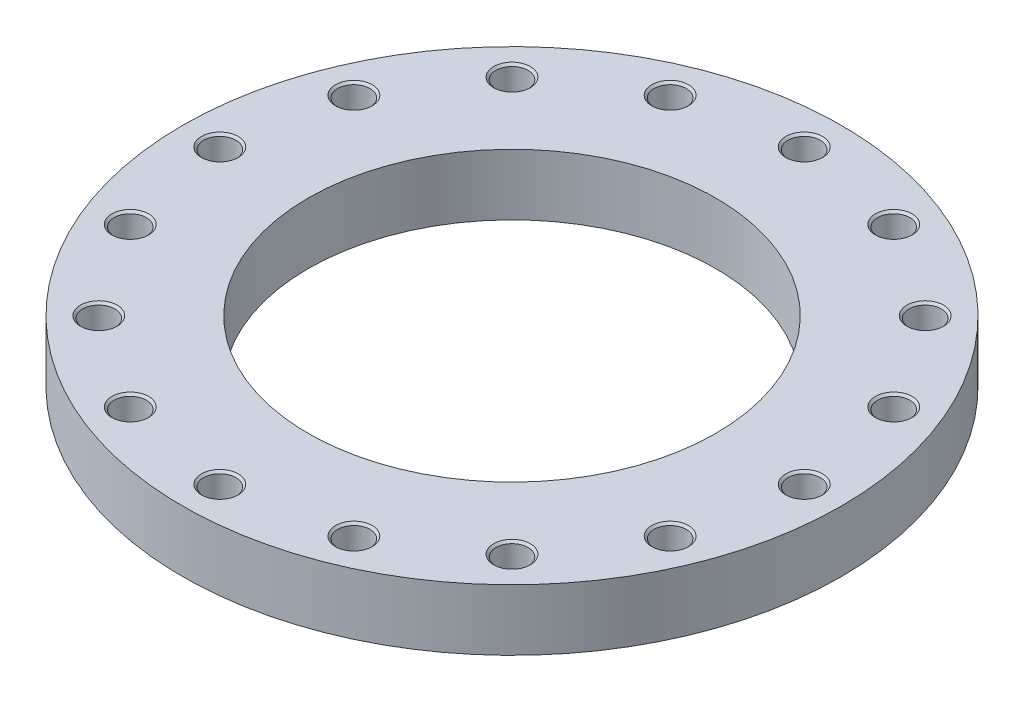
ISO-10303-21;
HEADER;
FILE_DESCRIPTION(('STEP AP214'),'2;1');
FILE_NAME('part.step','',(''),(''),'','','');
FILE_SCHEMA(('AUTOMOTIVE_DESIGN { 1 0 10303 214 1 1 1 1 }'));
ENDSEC;
DATA;
#1=APPLICATION_CONTEXT('core data for automotive mechanical design processes');
#2=APPLICATION_PROTOCOL_DEFINITION('international standard','automotive_design',2000,#1);
#3=PRODUCT_CONTEXT('',#1,'mechanical');
#4=PRODUCT('Part','Part','',(#3));
#5=PRODUCT_RELATED_PRODUCT_CATEGORY('part','',(#4));
#6=PRODUCT_DEFINITION_FORMATION('','',#4);
#7=PRODUCT_DEFINITION_CONTEXT('part definition',#1,'design');
#8=PRODUCT_DEFINITION('design','',#6,#7);
#9=PRODUCT_DEFINITION_SHAPE('','',#8);
#10=(LENGTH_UNIT() NAMED_UNIT(*) SI_UNIT(.MILLI.,.METRE.));
#11=(NAMED_UNIT(*) PLANE_ANGLE_UNIT() SI_UNIT($,.RADIAN.));
#12=(NAMED_UNIT(*) SI_UNIT($,.STERADIAN.) SOLID_ANGLE_UNIT());
#13=UNCERTAINTY_MEASURE_WITH_UNIT(LENGTH_MEASURE(1.E-05),#10,'distance_accuracy_value','');
#14=(GEOMETRIC_REPRESENTATION_CONTEXT(3) GLOBAL_UNCERTAINTY_ASSIGNED_CONTEXT((#13)) GLOBAL_UNIT_ASSIGNED_CONTEXT((#10,
#11,#12)) REPRESENTATION_CONTEXT('',''));
#15=CARTESIAN_POINT('',(0.,0.,0.));
#16=DIRECTION('',(0.,0.,1.));
#17=DIRECTION('',(1.,0.,0.));
#18=AXIS2_PLACEMENT_3D('',#15,#16,#17);
#19=CARTESIAN_POINT('',(0.,22.5,0.));
#20=DIRECTION('',(0.,-1.,0.));
#21=DIRECTION('',(1.,0.,0.));
#22=AXIS2_PLACEMENT_3D('',#19,#20,#21);
#23=CYLINDRICAL_SURFACE('',#22,242.5);
#24=CARTESIAN_POINT('',(0.,0.,0.));
#25=DIRECTION('',(0.,1.,0.));
#26=DIRECTION('',(1.,0.,0.));
#27=AXIS2_PLACEMENT_3D('',#24,#25,#26);
#28=CIRCLE('',#27,242.5);
#29=CARTESIAN_POINT('',(242.5,0.,0.));
#30=VERTEX_POINT('',#29);
#31=EDGE_CURVE('E9',#30,#30,#28,.T.);
#32=ORIENTED_EDGE('',*,*,#31,.T.);
#33=EDGE_LOOP('',(#32));
#34=FACE_BOUND('',#33,.T.);
#35=CARTESIAN_POINT('',(0.,45.,0.));
#36=DIRECTION('',(0.,1.,0.));
#37=DIRECTION('',(1.,0.,0.));
#38=AXIS2_PLACEMENT_3D('',#35,#36,#37);
#39=CIRCLE('',#38,242.5);
#40=CARTESIAN_POINT('',(242.5,45.,0.));
#41=VERTEX_POINT('',#40);
#42=EDGE_CURVE('E395',#41,#41,#39,.T.);
#43=ORIENTED_EDGE('',*,*,#42,.F.);
#44=EDGE_LOOP('',(#43));
#45=FACE_BOUND('',#44,.T.);
#46=ADVANCED_FACE('F15',(#34,#45),#23,.T.);
#47=CARTESIAN_POINT('',(196.25,0.,0.));
#48=DIRECTION('',(0.,-1.,0.));
#49=DIRECTION('',(-1.,0.,0.));
#50=AXIS2_PLACEMENT_3D('',#47,#48,#49);
#51=PLANE('',#50);
#52=CARTESIAN_POINT('',(0.,0.,0.));
#53=DIRECTION('',(0.,1.,0.));
#54=DIRECTION('',(1.,0.,0.));
#55=AXIS2_PLACEMENT_3D('',#52,#53,#54);
#56=CIRCLE('',#55,150.);
#57=CARTESIAN_POINT('',(150.,0.,0.));
#58=VERTEX_POINT('',#57);
#59=EDGE_CURVE('E24',#58,#58,#56,.T.);
#60=ORIENTED_EDGE('',*,*,#59,.T.);
#61=EDGE_LOOP('',(#60));
#62=FACE_BOUND('',#61,.T.);
#63=ORIENTED_EDGE('',*,*,#31,.F.);
#64=EDGE_LOOP('',(#63));
#65=FACE_BOUND('',#64,.T.);
#66=ADVANCED_FACE('F553',(#62,#65),#51,.T.);
#67=CARTESIAN_POINT('',(0.,22.5,0.));
#68=DIRECTION('',(0.,-1.,0.));
#69=DIRECTION('',(1.,0.,0.));
#70=AXIS2_PLACEMENT_3D('',#67,#68,#69);
#71=CYLINDRICAL_SURFACE('',#70,150.);
#72=CARTESIAN_POINT('',(0.,45.,0.));
#73=DIRECTION('',(0.,1.,0.));
#74=DIRECTION('',(1.,0.,0.));
#75=AXIS2_PLACEMENT_3D('',#72,#73,#74);
#76=CIRCLE('',#75,150.);
#77=CARTESIAN_POINT('',(150.,45.,0.));
#78=VERTEX_POINT('',#77);
#79=EDGE_CURVE('E19',#78,#78,#76,.T.);
#80=ORIENTED_EDGE('',*,*,#79,.T.);
#81=EDGE_LOOP('',(#80));
#82=FACE_BOUND('',#81,.T.);
#83=ORIENTED_EDGE('',*,*,#59,.F.);
#84=EDGE_LOOP('',(#83));
#85=FACE_BOUND('',#84,.T.);
#86=ADVANCED_FACE('F17',(#82,#85),#71,.F.);
#87=CARTESIAN_POINT('',(196.25,45.,0.));
#88=DIRECTION('',(0.,1.,0.));
#89=DIRECTION('',(1.,0.,0.));
#90=AXIS2_PLACEMENT_3D('',#87,#88,#89);
#91=PLANE('',#90);
#92=ORIENTED_EDGE('',*,*,#42,.T.);
#93=EDGE_LOOP('',(#92));
#94=FACE_BOUND('',#93,.T.);
#95=ORIENTED_EDGE('',*,*,#79,.F.);
#96=EDGE_LOOP('',(#95));
#97=FACE_BOUND('',#96,.T.);
#98=CARTESIAN_POINT('',(215.,45.,0.));
#99=DIRECTION('',(0.,-1.,0.));
#100=DIRECTION('',(1.,0.,0.));
#101=AXIS2_PLACEMENT_3D('',#98,#99,#100);
#102=CIRCLE('',#101,13.5);
#103=CARTESIAN_POINT('',(228.5,45.,0.));
#104=VERTEX_POINT('',#103);
#105=EDGE_CURVE('E382',#104,#104,#102,.T.);
#106=ORIENTED_EDGE('',*,*,#105,.T.);
#107=EDGE_LOOP('',(#106));
#108=FACE_BOUND('',#107,.T.);
#109=CARTESIAN_POINT('',(198.634099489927,45.,-82.2769379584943));
#110=DIRECTION('',(0.,-1.,0.));
#111=DIRECTION('',(0.923879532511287,0.,-0.38268343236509));
#112=AXIS2_PLACEMENT_3D('',#109,#110,#111);
#113=CIRCLE('',#112,13.5);
#114=CARTESIAN_POINT('',(211.106473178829,45.,-87.443164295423));
#115=VERTEX_POINT('',#114);
#116=EDGE_CURVE('E529',#115,#115,#113,.T.);
#117=ORIENTED_EDGE('',*,*,#116,.T.);
#118=EDGE_LOOP('',(#117));
#119=FACE_BOUND('',#118,.T.);
#120=CARTESIAN_POINT('',(152.027957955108,45.,-152.027957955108));
#121=DIRECTION('',(0.,-1.,0.));
#122=DIRECTION('',(0.707106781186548,0.,-0.707106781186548));
#123=AXIS2_PLACEMENT_3D('',#120,#121,#122);
#124=CIRCLE('',#123,13.5);
#125=CARTESIAN_POINT('',(161.573899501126,45.,-161.573899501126));
#126=VERTEX_POINT('',#125);
#127=EDGE_CURVE('E522',#126,#126,#124,.T.);
#128=ORIENTED_EDGE('',*,*,#127,.T.);
#129=EDGE_LOOP('',(#128));
#130=FACE_BOUND('',#129,.T.);
#131=CARTESIAN_POINT('',(82.2769379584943,45.,-198.634099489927));
#132=DIRECTION('',(0.,-1.,0.));
#133=DIRECTION('',(0.38268343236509,0.,-0.923879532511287));
#134=AXIS2_PLACEMENT_3D('',#131,#132,#133);
#135=CIRCLE('',#134,13.5);
#136=CARTESIAN_POINT('',(87.443164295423,45.,-211.106473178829));
#137=VERTEX_POINT('',#136);
#138=EDGE_CURVE('E516',#137,#137,#135,.T.);
#139=ORIENTED_EDGE('',*,*,#138,.T.);
#140=EDGE_LOOP('',(#139));
#141=FACE_BOUND('',#140,.T.);
#142=CARTESIAN_POINT('',(0.,45.,-215.));
#143=DIRECTION('',(0.,-1.,0.));
#144=DIRECTION('',(0.,0.,-1.));
#145=AXIS2_PLACEMENT_3D('',#142,#143,#144);
#146=CIRCLE('',#145,13.5);
#147=CARTESIAN_POINT('',(0.,45.,-228.5));
#148=VERTEX_POINT('',#147);
#149=EDGE_CURVE('E496',#148,#148,#146,.T.);
#150=ORIENTED_EDGE('',*,*,#149,.T.);
#151=EDGE_LOOP('',(#150));
#152=FACE_BOUND('',#151,.T.);
#153=CARTESIAN_POINT('',(-82.2769379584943,45.,-198.634099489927));
#154=DIRECTION('',(0.,-1.,0.));
#155=DIRECTION('',(-0.38268343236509,0.,-0.923879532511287));
#156=AXIS2_PLACEMENT_3D('',#153,#154,#155);
#157=CIRCLE('',#156,13.5);
#158=CARTESIAN_POINT('',(-87.443164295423,45.,-211.106473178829));
#159=VERTEX_POINT('',#158);
#160=EDGE_CURVE('E500',#159,#159,#157,.T.);
#161=ORIENTED_EDGE('',*,*,#160,.T.);
#162=EDGE_LOOP('',(#161));
#163=FACE_BOUND('',#162,.T.);
#164=CARTESIAN_POINT('',(-152.027957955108,45.,-152.027957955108));
#165=DIRECTION('',(0.,-1.,0.));
#166=DIRECTION('',(-0.707106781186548,0.,-0.707106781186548));
#167=AXIS2_PLACEMENT_3D('',#164,#165,#166);
#168=CIRCLE('',#167,13.5);
#169=CARTESIAN_POINT('',(-161.573899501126,45.,-161.573899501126));
#170=VERTEX_POINT('',#169);
#171=EDGE_CURVE('E480',#170,#170,#168,.T.);
#172=ORIENTED_EDGE('',*,*,#171,.T.);
#173=EDGE_LOOP('',(#172));
#174=FACE_BOUND('',#173,.T.);
#175=CARTESIAN_POINT('',(-198.634099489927,45.,-82.2769379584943));
#176=DIRECTION('',(0.,-1.,0.));
#177=DIRECTION('',(-0.923879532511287,0.,-0.38268343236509));
#178=AXIS2_PLACEMENT_3D('',#175,#176,#177);
#179=CIRCLE('',#178,13.5);
#180=CARTESIAN_POINT('',(-211.106473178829,45.,-87.443164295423));
#181=VERTEX_POINT('',#180);
#182=EDGE_CURVE('E466',#181,#181,#179,.T.);
#183=ORIENTED_EDGE('',*,*,#182,.T.);
#184=EDGE_LOOP('',(#183));
#185=FACE_BOUND('',#184,.T.);
#186=CARTESIAN_POINT('',(-215.,45.,0.));
#187=DIRECTION('',(0.,-1.,0.));
#188=DIRECTION('',(-1.,0.,0.));
#189=AXIS2_PLACEMENT_3D('',#186,#187,#188);
#190=CIRCLE('',#189,13.5);
#191=CARTESIAN_POINT('',(-228.5,45.,0.));
#192=VERTEX_POINT('',#191);
#193=EDGE_CURVE('E451',#192,#192,#190,.T.);
#194=ORIENTED_EDGE('',*,*,#193,.T.);
#195=EDGE_LOOP('',(#194));
#196=FACE_BOUND('',#195,.T.);
#197=CARTESIAN_POINT('',(-198.634099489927,45.,82.2769379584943));
#198=DIRECTION('',(0.,-1.,0.));
#199=DIRECTION('',(-0.923879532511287,0.,0.38268343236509));
#200=AXIS2_PLACEMENT_3D('',#197,#198,#199);
#201=CIRCLE('',#200,13.5);
#202=CARTESIAN_POINT('',(-211.106473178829,45.,87.443164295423));
#203=VERTEX_POINT('',#202);
#204=EDGE_CURVE('E436',#203,#203,#201,.T.);
#205=ORIENTED_EDGE('',*,*,#204,.T.);
#206=EDGE_LOOP('',(#205));
#207=FACE_BOUND('',#206,.T.);
#208=CARTESIAN_POINT('',(-152.027957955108,45.,152.027957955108));
#209=DIRECTION('',(0.,-1.,0.));
#210=DIRECTION('',(-0.707106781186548,0.,0.707106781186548));
#211=AXIS2_PLACEMENT_3D('',#208,#209,#210);
#212=CIRCLE('',#211,13.5);
#213=CARTESIAN_POINT('',(-161.573899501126,45.,161.573899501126));
#214=VERTEX_POINT('',#213);
#215=EDGE_CURVE('E426',#214,#214,#212,.T.);
#216=ORIENTED_EDGE('',*,*,#215,.T.);
#217=EDGE_LOOP('',(#216));
#218=FACE_BOUND('',#217,.T.);
#219=CARTESIAN_POINT('',(-82.2769379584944,45.,198.634099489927));
#220=DIRECTION('',(0.,-1.,0.));
#221=DIRECTION('',(-0.382683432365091,0.,0.923879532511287));
#222=AXIS2_PLACEMENT_3D('',#219,#220,#221);
#223=CIRCLE('',#222,13.5);
#224=CARTESIAN_POINT('',(-87.4431642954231,45.,211.106473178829));
#225=VERTEX_POINT('',#224);
#226=EDGE_CURVE('E414',#225,#225,#223,.T.);
#227=ORIENTED_EDGE('',*,*,#226,.T.);
#228=EDGE_LOOP('',(#227));
#229=FACE_BOUND('',#228,.T.);
#230=CARTESIAN_POINT('',(0.,45.,215.));
#231=DIRECTION('',(0.,-1.,0.));
#232=DIRECTION('',(0.,0.,1.));
#233=AXIS2_PLACEMENT_3D('',#230,#231,#232);
#234=CIRCLE('',#233,13.5);
#235=CARTESIAN_POINT('',(0.,45.,228.5));
#236=VERTEX_POINT('',#235);
#237=EDGE_CURVE('E841',#236,#236,#234,.T.);
#238=ORIENTED_EDGE('',*,*,#237,.T.);
#239=EDGE_LOOP('',(#238));
#240=FACE_BOUND('',#239,.T.);
#241=CARTESIAN_POINT('',(82.2769379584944,45.,198.634099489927));
#242=DIRECTION('',(0.,-1.,0.));
#243=DIRECTION('',(0.38268343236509,0.,0.923879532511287));
#244=AXIS2_PLACEMENT_3D('',#241,#242,#243);
#245=CIRCLE('',#244,13.5);
#246=CARTESIAN_POINT('',(87.4431642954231,45.,211.106473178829));
#247=VERTEX_POINT('',#246);
#248=EDGE_CURVE('E844',#247,#247,#245,.T.);
#249=ORIENTED_EDGE('',*,*,#248,.T.);
#250=EDGE_LOOP('',(#249));
#251=FACE_BOUND('',#250,.T.);
#252=CARTESIAN_POINT('',(152.027957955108,45.,152.027957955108));
#253=DIRECTION('',(0.,-1.,0.));
#254=DIRECTION('',(0.707106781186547,0.,0.707106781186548));
#255=AXIS2_PLACEMENT_3D('',#252,#253,#254);
#256=CIRCLE('',#255,13.5);
#257=CARTESIAN_POINT('',(161.573899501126,45.,161.573899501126));
#258=VERTEX_POINT('',#257);
#259=EDGE_CURVE('E847',#258,#258,#256,.T.);
#260=ORIENTED_EDGE('',*,*,#259,.T.);
#261=EDGE_LOOP('',(#260));
#262=FACE_BOUND('',#261,.T.);
#263=CARTESIAN_POINT('',(198.634099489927,45.,82.2769379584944));
#264=DIRECTION('',(0.,-1.,0.));
#265=DIRECTION('',(0.923879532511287,0.,0.382683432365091));
#266=AXIS2_PLACEMENT_3D('',#263,#264,#265);
#267=CIRCLE('',#266,13.5);
#268=CARTESIAN_POINT('',(211.106473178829,45.,87.4431642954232));
#269=VERTEX_POINT('',#268);
#270=EDGE_CURVE('E849',#269,#269,#267,.T.);
#271=ORIENTED_EDGE('',*,*,#270,.T.);
#272=EDGE_LOOP('',(#271));
#273=FACE_BOUND('',#272,.T.);
#274=ADVANCED_FACE('F726',(#94,#97,#108,#119,#130,#141,#152,#163,#174,#185,#196,#207,#218,#229,
#240,#251,#262,#273),#91,.T.);
#275=CARTESIAN_POINT('',(215.,5.57162193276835,0.));
#276=DIRECTION('',(0.,1.,0.));
#277=DIRECTION('',(1.,0.,0.));
#278=AXIS2_PLACEMENT_3D('',#275,#276,#277);
#279=CONICAL_SURFACE('',#278,5.938125,1.0471975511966);
#280=CARTESIAN_POINT('',(215.,9.,0.));
#281=DIRECTION('',(0.,-1.,0.));
#282=DIRECTION('',(1.,0.,0.));
#283=AXIS2_PLACEMENT_3D('',#280,#281,#282);
#284=CIRCLE('',#283,11.87625);
#285=CARTESIAN_POINT('',(226.87625,9.,0.));
#286=VERTEX_POINT('',#285);
#287=EDGE_CURVE('E392',#286,#286,#284,.T.);
#288=ORIENTED_EDGE('',*,*,#287,.F.);
#289=EDGE_LOOP('',(#288));
#290=FACE_BOUND('',#289,.T.);
#291=CARTESIAN_POINT('',(215.,2.1432438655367,0.));
#292=VERTEX_POINT('',#291);
#293=VERTEX_LOOP('',#292);
#294=FACE_BOUND('',#293,.T.);
#295=ADVANCED_FACE('F722',(#290,#294),#279,.F.);
#296=CARTESIAN_POINT('',(215.,13.688125,0.));
#297=DIRECTION('',(0.,1.,0.));
#298=DIRECTION('',(1.,0.,0.));
#299=AXIS2_PLACEMENT_3D('',#296,#297,#298);
#300=CYLINDRICAL_SURFACE('',#299,11.87625);
#301=CARTESIAN_POINT('',(215.,18.37625,0.));
#302=DIRECTION('',(0.,-1.,0.));
#303=DIRECTION('',(1.,0.,0.));
#304=AXIS2_PLACEMENT_3D('',#301,#302,#303);
#305=CIRCLE('',#304,11.87625);
#306=CARTESIAN_POINT('',(226.87625,18.37625,0.));
#307=VERTEX_POINT('',#306);
#308=EDGE_CURVE('E391',#307,#307,#305,.T.);
#309=ORIENTED_EDGE('',*,*,#308,.F.);
#310=EDGE_LOOP('',(#309));
#311=FACE_BOUND('',#310,.T.);
#312=ORIENTED_EDGE('',*,*,#287,.T.);
#313=EDGE_LOOP('',(#312));
#314=FACE_BOUND('',#313,.T.);
#315=ADVANCED_FACE('F725',(#311,#314),#300,.F.);
#316=CARTESIAN_POINT('',(215.,19.188125,0.));
#317=DIRECTION('',(0.,1.,0.));
#318=DIRECTION('',(1.,0.,0.));
#319=AXIS2_PLACEMENT_3D('',#316,#317,#318);
#320=CONICAL_SURFACE('',#319,12.688125,0.785398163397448);
#321=CARTESIAN_POINT('',(215.,20.,0.));
#322=DIRECTION('',(0.,-1.,0.));
#323=DIRECTION('',(1.,0.,0.));
#324=AXIS2_PLACEMENT_3D('',#321,#322,#323);
#325=CIRCLE('',#324,13.5);
#326=CARTESIAN_POINT('',(228.5,20.,0.));
#327=VERTEX_POINT('',#326);
#328=EDGE_CURVE('E390',#327,#327,#325,.T.);
#329=ORIENTED_EDGE('',*,*,#328,.F.);
#330=EDGE_LOOP('',(#329));
#331=FACE_BOUND('',#330,.T.);
#332=ORIENTED_EDGE('',*,*,#308,.T.);
#333=EDGE_LOOP('',(#332));
#334=FACE_BOUND('',#333,.T.);
#335=ADVANCED_FACE('F805',(#331,#334),#320,.F.);
#336=CARTESIAN_POINT('',(227.688125,20.,0.));
#337=DIRECTION('',(0.,1.,0.));
#338=DIRECTION('',(-1.,0.,0.));
#339=AXIS2_PLACEMENT_3D('',#336,#337,#338);
#340=PLANE('',#339);
#341=CARTESIAN_POINT('',(215.,20.,0.));
#342=DIRECTION('',(0.,-1.,0.));
#343=DIRECTION('',(1.,0.,0.));
#344=AXIS2_PLACEMENT_3D('',#341,#342,#343);
#345=CIRCLE('',#344,11.87625);
#346=CARTESIAN_POINT('',(226.87625,20.,0.));
#347=VERTEX_POINT('',#346);
#348=EDGE_CURVE('E388',#347,#347,#345,.T.);
#349=ORIENTED_EDGE('',*,*,#348,.F.);
#350=EDGE_LOOP('',(#349));
#351=FACE_BOUND('',#350,.T.);
#352=ORIENTED_EDGE('',*,*,#328,.T.);
#353=EDGE_LOOP('',(#352));
#354=FACE_BOUND('',#353,.T.);
#355=ADVANCED_FACE('F692',(#351,#354),#340,.F.);
#356=CARTESIAN_POINT('',(215.,31.688125,0.));
#357=DIRECTION('',(0.,1.,0.));
#358=DIRECTION('',(1.,0.,0.));
#359=AXIS2_PLACEMENT_3D('',#356,#357,#358);
#360=CYLINDRICAL_SURFACE('',#359,11.87625);
#361=CARTESIAN_POINT('',(215.,43.37625,0.));
#362=DIRECTION('',(0.,-1.,0.));
#363=DIRECTION('',(1.,0.,0.));
#364=AXIS2_PLACEMENT_3D('',#361,#362,#363);
#365=CIRCLE('',#364,11.87625);
#366=CARTESIAN_POINT('',(226.87625,43.37625,0.));
#367=VERTEX_POINT('',#366);
#368=EDGE_CURVE('E379',#367,#367,#365,.T.);
#369=ORIENTED_EDGE('',*,*,#368,.F.);
#370=EDGE_LOOP('',(#369));
#371=FACE_BOUND('',#370,.T.);
#372=ORIENTED_EDGE('',*,*,#348,.T.);
#373=EDGE_LOOP('',(#372));
#374=FACE_BOUND('',#373,.T.);
#375=ADVANCED_FACE('F689',(#371,#374),#360,.F.);
#376=CARTESIAN_POINT('',(215.,44.188125,0.));
#377=DIRECTION('',(0.,1.,0.));
#378=DIRECTION('',(1.,0.,0.));
#379=AXIS2_PLACEMENT_3D('',#376,#377,#378);
#380=CONICAL_SURFACE('',#379,12.688125,0.785398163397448);
#381=ORIENTED_EDGE('',*,*,#105,.F.);
#382=EDGE_LOOP('',(#381));
#383=FACE_BOUND('',#382,.T.);
#384=ORIENTED_EDGE('',*,*,#368,.T.);
#385=EDGE_LOOP('',(#384));
#386=FACE_BOUND('',#385,.T.);
#387=ADVANCED_FACE('F548',(#383,#386),#380,.F.);
#388=CARTESIAN_POINT('',(198.634099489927,5.57162193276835,-82.2769379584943));
#389=DIRECTION('',(0.,1.,0.));
#390=DIRECTION('',(0.923879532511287,0.,-0.38268343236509));
#391=AXIS2_PLACEMENT_3D('',#388,#389,#390);
#392=CONICAL_SURFACE('',#391,5.938125,1.0471975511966);
#393=CARTESIAN_POINT('',(198.634099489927,9.,-82.2769379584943));
#394=DIRECTION('',(0.,-1.,0.));
#395=DIRECTION('',(0.923879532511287,0.,-0.38268343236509));
#396=AXIS2_PLACEMENT_3D('',#393,#394,#395);
#397=CIRCLE('',#396,11.87625);
#398=CARTESIAN_POINT('',(209.606323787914,9.,-86.8217820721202));
#399=VERTEX_POINT('',#398);
#400=EDGE_CURVE('E376',#399,#399,#397,.T.);
#401=ORIENTED_EDGE('',*,*,#400,.F.);
#402=EDGE_LOOP('',(#401));
#403=FACE_BOUND('',#402,.T.);
#404=CARTESIAN_POINT('',(198.634099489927,2.1432438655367,-82.2769379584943));
#405=VERTEX_POINT('',#404);
#406=VERTEX_LOOP('',#405);
#407=FACE_BOUND('',#406,.T.);
#408=ADVANCED_FACE('F542',(#403,#407),#392,.F.);
#409=CARTESIAN_POINT('',(198.634099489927,13.688125,-82.2769379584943));
#410=DIRECTION('',(0.,1.,0.));
#411=DIRECTION('',(0.923879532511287,0.,-0.38268343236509));
#412=AXIS2_PLACEMENT_3D('',#409,#410,#411);
#413=CYLINDRICAL_SURFACE('',#412,11.87625);
#414=CARTESIAN_POINT('',(198.634099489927,18.37625,-82.2769379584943));
#415=DIRECTION('',(0.,-1.,0.));
#416=DIRECTION('',(0.923879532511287,0.,-0.38268343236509));
#417=AXIS2_PLACEMENT_3D('',#414,#415,#416);
#418=CIRCLE('',#417,11.87625);
#419=CARTESIAN_POINT('',(209.606323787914,18.37625,-86.8217820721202));
#420=VERTEX_POINT('',#419);
#421=EDGE_CURVE('E380',#420,#420,#418,.T.);
#422=ORIENTED_EDGE('',*,*,#421,.F.);
#423=EDGE_LOOP('',(#422));
#424=FACE_BOUND('',#423,.T.);
#425=ORIENTED_EDGE('',*,*,#400,.T.);
#426=EDGE_LOOP('',(#425));
#427=FACE_BOUND('',#426,.T.);
#428=ADVANCED_FACE('F377',(#424,#427),#413,.F.);
#429=CARTESIAN_POINT('',(198.634099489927,19.188125,-82.2769379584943));
#430=DIRECTION('',(0.,1.,0.));
#431=DIRECTION('',(0.923879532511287,0.,-0.38268343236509));
#432=AXIS2_PLACEMENT_3D('',#429,#430,#431);
#433=CONICAL_SURFACE('',#432,12.688125,0.785398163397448);
#434=CARTESIAN_POINT('',(198.634099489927,20.,-82.2769379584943));
#435=DIRECTION('',(0.,-1.,0.));
#436=DIRECTION('',(0.923879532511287,0.,-0.38268343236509));
#437=AXIS2_PLACEMENT_3D('',#434,#435,#436);
#438=CIRCLE('',#437,13.5);
#439=CARTESIAN_POINT('',(211.106473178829,20.,-87.443164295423));
#440=VERTEX_POINT('',#439);
#441=EDGE_CURVE('E384',#440,#440,#438,.T.);
#442=ORIENTED_EDGE('',*,*,#441,.F.);
#443=EDGE_LOOP('',(#442));
#444=FACE_BOUND('',#443,.T.);
#445=ORIENTED_EDGE('',*,*,#421,.T.);
#446=EDGE_LOOP('',(#445));
#447=FACE_BOUND('',#446,.T.);
#448=ADVANCED_FACE('F535',(#444,#447),#433,.F.);
#449=CARTESIAN_POINT('',(210.356398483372,20.,-87.1324731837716));
#450=DIRECTION('',(0.,1.,0.));
#451=DIRECTION('',(-0.923879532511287,0.,0.38268343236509));
#452=AXIS2_PLACEMENT_3D('',#449,#450,#451);
#453=PLANE('',#452);
#454=CARTESIAN_POINT('',(198.634099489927,20.,-82.2769379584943));
#455=DIRECTION('',(0.,-1.,0.));
#456=DIRECTION('',(0.923879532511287,0.,-0.38268343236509));
#457=AXIS2_PLACEMENT_3D('',#454,#455,#456);
#458=CIRCLE('',#457,11.87625);
#459=CARTESIAN_POINT('',(209.606323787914,20.,-86.8217820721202));
#460=VERTEX_POINT('',#459);
#461=EDGE_CURVE('E530',#460,#460,#458,.T.);
#462=ORIENTED_EDGE('',*,*,#461,.F.);
#463=EDGE_LOOP('',(#462));
#464=FACE_BOUND('',#463,.T.);
#465=ORIENTED_EDGE('',*,*,#441,.T.);
#466=EDGE_LOOP('',(#465));
#467=FACE_BOUND('',#466,.T.);
#468=ADVANCED_FACE('F533',(#464,#467),#453,.F.);
#469=CARTESIAN_POINT('',(198.634099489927,31.688125,-82.2769379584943));
#470=DIRECTION('',(0.,1.,0.));
#471=DIRECTION('',(0.923879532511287,0.,-0.38268343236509));
#472=AXIS2_PLACEMENT_3D('',#469,#470,#471);
#473=CYLINDRICAL_SURFACE('',#472,11.87625);
#474=CARTESIAN_POINT('',(198.634099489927,43.37625,-82.2769379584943));
#475=DIRECTION('',(0.,-1.,0.));
#476=DIRECTION('',(0.923879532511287,0.,-0.38268343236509));
#477=AXIS2_PLACEMENT_3D('',#474,#475,#476);
#478=CIRCLE('',#477,11.87625);
#479=CARTESIAN_POINT('',(209.606323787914,43.37625,-86.8217820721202));
#480=VERTEX_POINT('',#479);
#481=EDGE_CURVE('E483',#480,#480,#478,.T.);
#482=ORIENTED_EDGE('',*,*,#481,.F.);
#483=EDGE_LOOP('',(#482));
#484=FACE_BOUND('',#483,.T.);
#485=ORIENTED_EDGE('',*,*,#461,.T.);
#486=EDGE_LOOP('',(#485));
#487=FACE_BOUND('',#486,.T.);
#488=ADVANCED_FACE('F679',(#484,#487),#473,.F.);
#489=CARTESIAN_POINT('',(198.634099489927,44.188125,-82.2769379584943));
#490=DIRECTION('',(0.,1.,0.));
#491=DIRECTION('',(0.923879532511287,0.,-0.38268343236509));
#492=AXIS2_PLACEMENT_3D('',#489,#490,#491);
#493=CONICAL_SURFACE('',#492,12.688125,0.785398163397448);
#494=ORIENTED_EDGE('',*,*,#116,.F.);
#495=EDGE_LOOP('',(#494));
#496=FACE_BOUND('',#495,.T.);
#497=ORIENTED_EDGE('',*,*,#481,.T.);
#498=EDGE_LOOP('',(#497));
#499=FACE_BOUND('',#498,.T.);
#500=ADVANCED_FACE('F675',(#496,#499),#493,.F.);
#501=CARTESIAN_POINT('',(152.027957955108,5.57162193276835,-152.027957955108));
#502=DIRECTION('',(0.,1.,0.));
#503=DIRECTION('',(0.707106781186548,0.,-0.707106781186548));
#504=AXIS2_PLACEMENT_3D('',#501,#502,#503);
#505=CONICAL_SURFACE('',#504,5.938125,1.0471975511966);
#506=CARTESIAN_POINT('',(152.027957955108,9.,-152.027957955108));
#507=DIRECTION('',(0.,-1.,0.));
#508=DIRECTION('',(0.707106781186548,0.,-0.707106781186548));
#509=AXIS2_PLACEMENT_3D('',#506,#507,#508);
#510=CIRCLE('',#509,11.87625);
#511=CARTESIAN_POINT('',(160.425734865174,9.,-160.425734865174));
#512=VERTEX_POINT('',#511);
#513=EDGE_CURVE('E481',#512,#512,#510,.T.);
#514=ORIENTED_EDGE('',*,*,#513,.F.);
#515=EDGE_LOOP('',(#514));
#516=FACE_BOUND('',#515,.T.);
#517=CARTESIAN_POINT('',(152.027957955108,2.1432438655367,-152.027957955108));
#518=VERTEX_POINT('',#517);
#519=VERTEX_LOOP('',#518);
#520=FACE_BOUND('',#519,.T.);
#521=ADVANCED_FACE('F678',(#516,#520),#505,.F.);
#522=CARTESIAN_POINT('',(152.027957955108,13.688125,-152.027957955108));
#523=DIRECTION('',(0.,1.,0.));
#524=DIRECTION('',(0.707106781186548,0.,-0.707106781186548));
#525=AXIS2_PLACEMENT_3D('',#522,#523,#524);
#526=CYLINDRICAL_SURFACE('',#525,11.87625);
#527=CARTESIAN_POINT('',(152.027957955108,18.37625,-152.027957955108));
#528=DIRECTION('',(0.,-1.,0.));
#529=DIRECTION('',(0.707106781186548,0.,-0.707106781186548));
#530=AXIS2_PLACEMENT_3D('',#527,#528,#529);
#531=CIRCLE('',#530,11.87625);
#532=CARTESIAN_POINT('',(160.425734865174,18.37625,-160.425734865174));
#533=VERTEX_POINT('',#532);
#534=EDGE_CURVE('E484',#533,#533,#531,.T.);
#535=ORIENTED_EDGE('',*,*,#534,.F.);
#536=EDGE_LOOP('',(#535));
#537=FACE_BOUND('',#536,.T.);
#538=ORIENTED_EDGE('',*,*,#513,.T.);
#539=EDGE_LOOP('',(#538));
#540=FACE_BOUND('',#539,.T.);
#541=ADVANCED_FACE('F792',(#537,#540),#526,.F.);
#542=CARTESIAN_POINT('',(152.027957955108,19.188125,-152.027957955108));
#543=DIRECTION('',(0.,1.,0.));
#544=DIRECTION('',(0.707106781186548,0.,-0.707106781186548));
#545=AXIS2_PLACEMENT_3D('',#542,#543,#544);
#546=CONICAL_SURFACE('',#545,12.688125,0.785398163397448);
#547=CARTESIAN_POINT('',(152.027957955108,20.,-152.027957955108));
#548=DIRECTION('',(0.,-1.,0.));
#549=DIRECTION('',(0.707106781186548,0.,-0.707106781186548));
#550=AXIS2_PLACEMENT_3D('',#547,#548,#549);
#551=CIRCLE('',#550,13.5);
#552=CARTESIAN_POINT('',(161.573899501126,20.,-161.573899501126));
#553=VERTEX_POINT('',#552);
#554=EDGE_CURVE('E526',#553,#553,#551,.T.);
#555=ORIENTED_EDGE('',*,*,#554,.F.);
#556=EDGE_LOOP('',(#555));
#557=FACE_BOUND('',#556,.T.);
#558=ORIENTED_EDGE('',*,*,#534,.T.);
#559=EDGE_LOOP('',(#558));
#560=FACE_BOUND('',#559,.T.);
#561=ADVANCED_FACE('F788',(#557,#560),#546,.F.);
#562=CARTESIAN_POINT('',(160.99981718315,20.,-160.99981718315));
#563=DIRECTION('',(0.,1.,0.));
#564=DIRECTION('',(-0.707106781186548,0.,0.707106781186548));
#565=AXIS2_PLACEMENT_3D('',#562,#563,#564);
#566=PLANE('',#565);
#567=CARTESIAN_POINT('',(152.027957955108,20.,-152.027957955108));
#568=DIRECTION('',(0.,-1.,0.));
#569=DIRECTION('',(0.707106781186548,0.,-0.707106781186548));
#570=AXIS2_PLACEMENT_3D('',#567,#568,#569);
#571=CIRCLE('',#570,11.87625);
#572=CARTESIAN_POINT('',(160.425734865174,20.,-160.425734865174));
#573=VERTEX_POINT('',#572);
#574=EDGE_CURVE('E524',#573,#573,#571,.T.);
#575=ORIENTED_EDGE('',*,*,#574,.F.);
#576=EDGE_LOOP('',(#575));
#577=FACE_BOUND('',#576,.T.);
#578=ORIENTED_EDGE('',*,*,#554,.T.);
#579=EDGE_LOOP('',(#578));
#580=FACE_BOUND('',#579,.T.);
#581=ADVANCED_FACE('F653',(#577,#580),#566,.F.);
#582=CARTESIAN_POINT('',(152.027957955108,31.688125,-152.027957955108));
#583=DIRECTION('',(0.,1.,0.));
#584=DIRECTION('',(0.707106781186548,0.,-0.707106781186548));
#585=AXIS2_PLACEMENT_3D('',#582,#583,#584);
#586=CYLINDRICAL_SURFACE('',#585,11.87625);
#587=CARTESIAN_POINT('',(152.027957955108,43.37625,-152.027957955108));
#588=DIRECTION('',(0.,-1.,0.));
#589=DIRECTION('',(0.707106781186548,0.,-0.707106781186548));
#590=AXIS2_PLACEMENT_3D('',#587,#588,#589);
#591=CIRCLE('',#590,11.87625);
#592=CARTESIAN_POINT('',(160.425734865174,43.37625,-160.425734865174));
#593=VERTEX_POINT('',#592);
#594=EDGE_CURVE('E470',#593,#593,#591,.T.);
#595=ORIENTED_EDGE('',*,*,#594,.F.);
#596=EDGE_LOOP('',(#595));
#597=FACE_BOUND('',#596,.T.);
#598=ORIENTED_EDGE('',*,*,#574,.T.);
#599=EDGE_LOOP('',(#598));
#600=FACE_BOUND('',#599,.T.);
#601=ADVANCED_FACE('F649',(#597,#600),#586,.F.);
#602=CARTESIAN_POINT('',(152.027957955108,44.188125,-152.027957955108));
#603=DIRECTION('',(0.,1.,0.));
#604=DIRECTION('',(0.707106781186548,0.,-0.707106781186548));
#605=AXIS2_PLACEMENT_3D('',#602,#603,#604);
#606=CONICAL_SURFACE('',#605,12.688125,0.785398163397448);
#607=ORIENTED_EDGE('',*,*,#127,.F.);
#608=EDGE_LOOP('',(#607));
#609=FACE_BOUND('',#608,.T.);
#610=ORIENTED_EDGE('',*,*,#594,.T.);
#611=EDGE_LOOP('',(#610));
#612=FACE_BOUND('',#611,.T.);
#613=ADVANCED_FACE('F652',(#609,#612),#606,.F.);
#614=CARTESIAN_POINT('',(82.2769379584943,5.57162193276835,-198.634099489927));
#615=DIRECTION('',(0.,1.,0.));
#616=DIRECTION('',(0.38268343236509,0.,-0.923879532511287));
#617=AXIS2_PLACEMENT_3D('',#614,#615,#616);
#618=CONICAL_SURFACE('',#617,5.938125,1.0471975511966);
#619=CARTESIAN_POINT('',(82.2769379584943,9.,-198.634099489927));
#620=DIRECTION('',(0.,-1.,0.));
#621=DIRECTION('',(0.38268343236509,0.,-0.923879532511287));
#622=AXIS2_PLACEMENT_3D('',#619,#620,#621);
#623=CIRCLE('',#622,11.87625);
#624=CARTESIAN_POINT('',(86.8217820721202,9.,-209.606323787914));
#625=VERTEX_POINT('',#624);
#626=EDGE_CURVE('E446',#625,#625,#623,.T.);
#627=ORIENTED_EDGE('',*,*,#626,.F.);
#628=EDGE_LOOP('',(#627));
#629=FACE_BOUND('',#628,.T.);
#630=CARTESIAN_POINT('',(82.2769379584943,2.1432438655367,-198.634099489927));
#631=VERTEX_POINT('',#630);
#632=VERTEX_LOOP('',#631);
#633=FACE_BOUND('',#632,.T.);
#634=ADVANCED_FACE('F778',(#629,#633),#618,.F.);
#635=CARTESIAN_POINT('',(82.2769379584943,13.688125,-198.634099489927));
#636=DIRECTION('',(0.,1.,0.));
#637=DIRECTION('',(0.38268343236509,0.,-0.923879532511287));
#638=AXIS2_PLACEMENT_3D('',#635,#636,#637);
#639=CYLINDRICAL_SURFACE('',#638,11.87625);
#640=CARTESIAN_POINT('',(82.2769379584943,18.37625,-198.634099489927));
#641=DIRECTION('',(0.,-1.,0.));
#642=DIRECTION('',(0.38268343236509,0.,-0.923879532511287));
#643=AXIS2_PLACEMENT_3D('',#640,#641,#642);
#644=CIRCLE('',#643,11.87625);
#645=CARTESIAN_POINT('',(86.8217820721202,18.37625,-209.606323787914));
#646=VERTEX_POINT('',#645);
#647=EDGE_CURVE('E444',#646,#646,#644,.T.);
#648=ORIENTED_EDGE('',*,*,#647,.F.);
#649=EDGE_LOOP('',(#648));
#650=FACE_BOUND('',#649,.T.);
#651=ORIENTED_EDGE('',*,*,#626,.T.);
#652=EDGE_LOOP('',(#651));
#653=FACE_BOUND('',#652,.T.);
#654=ADVANCED_FACE('F774',(#650,#653),#639,.F.);
#655=CARTESIAN_POINT('',(82.2769379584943,19.188125,-198.634099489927));
#656=DIRECTION('',(0.,1.,0.));
#657=DIRECTION('',(0.38268343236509,0.,-0.923879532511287));
#658=AXIS2_PLACEMENT_3D('',#655,#656,#657);
#659=CONICAL_SURFACE('',#658,12.688125,0.785398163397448);
#660=CARTESIAN_POINT('',(82.2769379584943,20.,-198.634099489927));
#661=DIRECTION('',(0.,-1.,0.));
#662=DIRECTION('',(0.38268343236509,0.,-0.923879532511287));
#663=AXIS2_PLACEMENT_3D('',#660,#661,#662);
#664=CIRCLE('',#663,13.5);
#665=CARTESIAN_POINT('',(87.443164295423,20.,-211.106473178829));
#666=VERTEX_POINT('',#665);
#667=EDGE_CURVE('E447',#666,#666,#664,.T.);
#668=ORIENTED_EDGE('',*,*,#667,.F.);
#669=EDGE_LOOP('',(#668));
#670=FACE_BOUND('',#669,.T.);
#671=ORIENTED_EDGE('',*,*,#647,.T.);
#672=EDGE_LOOP('',(#671));
#673=FACE_BOUND('',#672,.T.);
#674=ADVANCED_FACE('F770',(#670,#673),#659,.F.);
#675=CARTESIAN_POINT('',(87.1324731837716,20.,-210.356398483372));
#676=DIRECTION('',(0.,1.,0.));
#677=DIRECTION('',(-0.38268343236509,0.,0.923879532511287));
#678=AXIS2_PLACEMENT_3D('',#675,#676,#677);
#679=PLANE('',#678);
#680=CARTESIAN_POINT('',(82.2769379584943,20.,-198.634099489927));
#681=DIRECTION('',(0.,-1.,0.));
#682=DIRECTION('',(0.38268343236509,0.,-0.923879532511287));
#683=AXIS2_PLACEMENT_3D('',#680,#681,#682);
#684=CIRCLE('',#683,11.87625);
#685=CARTESIAN_POINT('',(86.8217820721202,20.,-209.606323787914));
#686=VERTEX_POINT('',#685);
#687=EDGE_CURVE('E518',#686,#686,#684,.T.);
#688=ORIENTED_EDGE('',*,*,#687,.F.);
#689=EDGE_LOOP('',(#688));
#690=FACE_BOUND('',#689,.T.);
#691=ORIENTED_EDGE('',*,*,#667,.T.);
#692=EDGE_LOOP('',(#691));
#693=FACE_BOUND('',#692,.T.);
#694=ADVANCED_FACE('F599',(#690,#693),#679,.F.);
#695=CARTESIAN_POINT('',(82.2769379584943,31.688125,-198.634099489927));
#696=DIRECTION('',(0.,1.,0.));
#697=DIRECTION('',(0.38268343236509,0.,-0.923879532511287));
#698=AXIS2_PLACEMENT_3D('',#695,#696,#697);
#699=CYLINDRICAL_SURFACE('',#698,11.87625);
#700=CARTESIAN_POINT('',(82.2769379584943,43.37625,-198.634099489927));
#701=DIRECTION('',(0.,-1.,0.));
#702=DIRECTION('',(0.38268343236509,0.,-0.923879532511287));
#703=AXIS2_PLACEMENT_3D('',#700,#701,#702);
#704=CIRCLE('',#703,11.87625);
#705=CARTESIAN_POINT('',(86.8217820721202,43.37625,-209.606323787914));
#706=VERTEX_POINT('',#705);
#707=EDGE_CURVE('E459',#706,#706,#704,.T.);
#708=ORIENTED_EDGE('',*,*,#707,.F.);
#709=EDGE_LOOP('',(#708));
#710=FACE_BOUND('',#709,.T.);
#711=ORIENTED_EDGE('',*,*,#687,.T.);
#712=EDGE_LOOP('',(#711));
#713=FACE_BOUND('',#712,.T.);
#714=ADVANCED_FACE('F595',(#710,#713),#699,.F.);
#715=CARTESIAN_POINT('',(82.2769379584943,44.188125,-198.634099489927));
#716=DIRECTION('',(0.,1.,0.));
#717=DIRECTION('',(0.38268343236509,0.,-0.923879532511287));
#718=AXIS2_PLACEMENT_3D('',#715,#716,#717);
#719=CONICAL_SURFACE('',#718,12.688125,0.785398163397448);
#720=ORIENTED_EDGE('',*,*,#138,.F.);
#721=EDGE_LOOP('',(#720));
#722=FACE_BOUND('',#721,.T.);
#723=ORIENTED_EDGE('',*,*,#707,.T.);
#724=EDGE_LOOP('',(#723));
#725=FACE_BOUND('',#724,.T.);
#726=ADVANCED_FACE('F598',(#722,#725),#719,.F.);
#727=CARTESIAN_POINT('',(0.,5.57162193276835,-215.));
#728=DIRECTION('',(0.,1.,0.));
#729=DIRECTION('',(0.,0.,-1.));
#730=AXIS2_PLACEMENT_3D('',#727,#728,#729);
#731=CONICAL_SURFACE('',#730,5.938125,1.0471975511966);
#732=CARTESIAN_POINT('',(0.,9.,-215.));
#733=DIRECTION('',(0.,-1.,0.));
#734=DIRECTION('',(0.,0.,-1.));
#735=AXIS2_PLACEMENT_3D('',#732,#733,#734);
#736=CIRCLE('',#735,11.87625);
#737=CARTESIAN_POINT('',(0.,9.,-226.87625));
#738=VERTEX_POINT('',#737);
#739=EDGE_CURVE('E457',#738,#738,#736,.T.);
#740=ORIENTED_EDGE('',*,*,#739,.F.);
#741=EDGE_LOOP('',(#740));
#742=FACE_BOUND('',#741,.T.);
#743=CARTESIAN_POINT('',(0.,2.1432438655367,-215.));
#744=VERTEX_POINT('',#743);
#745=VERTEX_LOOP('',#744);
#746=FACE_BOUND('',#745,.T.);
#747=ADVANCED_FACE('F760',(#742,#746),#731,.F.);
#748=CARTESIAN_POINT('',(0.,13.688125,-215.));
#749=DIRECTION('',(0.,1.,0.));
#750=DIRECTION('',(0.,0.,-1.));
#751=AXIS2_PLACEMENT_3D('',#748,#749,#750);
#752=CYLINDRICAL_SURFACE('',#751,11.87625);
#753=CARTESIAN_POINT('',(0.,18.37625,-215.));
#754=DIRECTION('',(0.,-1.,0.));
#755=DIRECTION('',(0.,0.,-1.));
#756=AXIS2_PLACEMENT_3D('',#753,#754,#755);
#757=CIRCLE('',#756,11.87625);
#758=CARTESIAN_POINT('',(0.,18.37625,-226.87625));
#759=VERTEX_POINT('',#758);
#760=EDGE_CURVE('E460',#759,#759,#757,.T.);
#761=ORIENTED_EDGE('',*,*,#760,.F.);
#762=EDGE_LOOP('',(#761));
#763=FACE_BOUND('',#762,.T.);
#764=ORIENTED_EDGE('',*,*,#739,.T.);
#765=EDGE_LOOP('',(#764));
#766=FACE_BOUND('',#765,.T.);
#767=ADVANCED_FACE('F757',(#763,#766),#752,.F.);
#768=CARTESIAN_POINT('',(0.,19.188125,-215.));
#769=DIRECTION('',(0.,1.,0.));
#770=DIRECTION('',(0.,0.,-1.));
#771=AXIS2_PLACEMENT_3D('',#768,#769,#770);
#772=CONICAL_SURFACE('',#771,12.688125,0.785398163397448);
#773=CARTESIAN_POINT('',(0.,20.,-215.));
#774=DIRECTION('',(0.,-1.,0.));
#775=DIRECTION('',(0.,0.,-1.));
#776=AXIS2_PLACEMENT_3D('',#773,#774,#775);
#777=CIRCLE('',#776,13.5);
#778=CARTESIAN_POINT('',(0.,20.,-228.5));
#779=VERTEX_POINT('',#778);
#780=EDGE_CURVE('E495',#779,#779,#777,.T.);
#781=ORIENTED_EDGE('',*,*,#780,.F.);
#782=EDGE_LOOP('',(#781));
#783=FACE_BOUND('',#782,.T.);
#784=ORIENTED_EDGE('',*,*,#760,.T.);
#785=EDGE_LOOP('',(#784));
#786=FACE_BOUND('',#785,.T.);
#787=ADVANCED_FACE('F755',(#783,#786),#772,.F.);
#788=CARTESIAN_POINT('',(0.,20.,-227.688125));
#789=DIRECTION('',(0.,1.,0.));
#790=DIRECTION('',(0.,0.,1.));
#791=AXIS2_PLACEMENT_3D('',#788,#789,#790);
#792=PLANE('',#791);
#793=CARTESIAN_POINT('',(0.,20.,-215.));
#794=DIRECTION('',(0.,-1.,0.));
#795=DIRECTION('',(0.,0.,-1.));
#796=AXIS2_PLACEMENT_3D('',#793,#794,#795);
#797=CIRCLE('',#796,11.87625);
#798=CARTESIAN_POINT('',(0.,20.,-226.87625));
#799=VERTEX_POINT('',#798);
#800=EDGE_CURVE('E493',#799,#799,#797,.T.);
#801=ORIENTED_EDGE('',*,*,#800,.F.);
#802=EDGE_LOOP('',(#801));
#803=FACE_BOUND('',#802,.T.);
#804=ORIENTED_EDGE('',*,*,#780,.T.);
#805=EDGE_LOOP('',(#804));
#806=FACE_BOUND('',#805,.T.);
#807=ADVANCED_FACE('F751',(#803,#806),#792,.F.);
#808=CARTESIAN_POINT('',(0.,31.688125,-215.));
#809=DIRECTION('',(0.,1.,0.));
#810=DIRECTION('',(0.,0.,-1.));
#811=AXIS2_PLACEMENT_3D('',#808,#809,#810);
#812=CYLINDRICAL_SURFACE('',#811,11.87625);
#813=CARTESIAN_POINT('',(0.,43.37625,-215.));
#814=DIRECTION('',(0.,-1.,0.));
#815=DIRECTION('',(0.,0.,-1.));
#816=AXIS2_PLACEMENT_3D('',#813,#814,#815);
#817=CIRCLE('',#816,11.87625);
#818=CARTESIAN_POINT('',(0.,43.37625,-226.87625));
#819=VERTEX_POINT('',#818);
#820=EDGE_CURVE('E511',#819,#819,#817,.T.);
#821=ORIENTED_EDGE('',*,*,#820,.F.);
#822=EDGE_LOOP('',(#821));
#823=FACE_BOUND('',#822,.T.);
#824=ORIENTED_EDGE('',*,*,#800,.T.);
#825=EDGE_LOOP('',(#824));
#826=FACE_BOUND('',#825,.T.);
#827=ADVANCED_FACE('F748',(#823,#826),#812,.F.);
#828=CARTESIAN_POINT('',(0.,44.188125,-215.));
#829=DIRECTION('',(0.,1.,0.));
#830=DIRECTION('',(0.,0.,-1.));
#831=AXIS2_PLACEMENT_3D('',#828,#829,#830);
#832=CONICAL_SURFACE('',#831,12.688125,0.785398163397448);
#833=ORIENTED_EDGE('',*,*,#149,.F.);
#834=EDGE_LOOP('',(#833));
#835=FACE_BOUND('',#834,.T.);
#836=ORIENTED_EDGE('',*,*,#820,.T.);
#837=EDGE_LOOP('',(#836));
#838=FACE_BOUND('',#837,.T.);
#839=ADVANCED_FACE('F746',(#835,#838),#832,.F.);
#840=CARTESIAN_POINT('',(-82.2769379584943,5.57162193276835,-198.634099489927));
#841=DIRECTION('',(0.,1.,0.));
#842=DIRECTION('',(-0.38268343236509,0.,-0.923879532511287));
#843=AXIS2_PLACEMENT_3D('',#840,#841,#842);
#844=CONICAL_SURFACE('',#843,5.938125,1.0471975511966);
#845=CARTESIAN_POINT('',(-82.2769379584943,9.,-198.634099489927));
#846=DIRECTION('',(0.,-1.,0.));
#847=DIRECTION('',(-0.38268343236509,0.,-0.923879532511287));
#848=AXIS2_PLACEMENT_3D('',#845,#846,#847);
#849=CIRCLE('',#848,11.87625);
#850=CARTESIAN_POINT('',(-86.8217820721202,9.,-209.606323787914));
#851=VERTEX_POINT('',#850);
#852=EDGE_CURVE('E509',#851,#851,#849,.T.);
#853=ORIENTED_EDGE('',*,*,#852,.F.);
#854=EDGE_LOOP('',(#853));
#855=FACE_BOUND('',#854,.T.);
#856=CARTESIAN_POINT('',(-82.2769379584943,2.1432438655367,-198.634099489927));
#857=VERTEX_POINT('',#856);
#858=VERTEX_LOOP('',#857);
#859=FACE_BOUND('',#858,.T.);
#860=ADVANCED_FACE('F742',(#855,#859),#844,.F.);
#861=CARTESIAN_POINT('',(-82.2769379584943,13.688125,-198.634099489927));
#862=DIRECTION('',(0.,1.,0.));
#863=DIRECTION('',(-0.38268343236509,0.,-0.923879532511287));
#864=AXIS2_PLACEMENT_3D('',#861,#862,#863);
#865=CYLINDRICAL_SURFACE('',#864,11.87625);
#866=CARTESIAN_POINT('',(-82.2769379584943,18.37625,-198.634099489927));
#867=DIRECTION('',(0.,-1.,0.));
#868=DIRECTION('',(-0.38268343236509,0.,-0.923879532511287));
#869=AXIS2_PLACEMENT_3D('',#866,#867,#868);
#870=CIRCLE('',#869,11.87625);
#871=CARTESIAN_POINT('',(-86.8217820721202,18.37625,-209.606323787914));
#872=VERTEX_POINT('',#871);
#873=EDGE_CURVE('E507',#872,#872,#870,.T.);
#874=ORIENTED_EDGE('',*,*,#873,.F.);
#875=EDGE_LOOP('',(#874));
#876=FACE_BOUND('',#875,.T.);
#877=ORIENTED_EDGE('',*,*,#852,.T.);
#878=EDGE_LOOP('',(#877));
#879=FACE_BOUND('',#878,.T.);
#880=ADVANCED_FACE('F738',(#876,#879),#865,.F.);
#881=CARTESIAN_POINT('',(-82.2769379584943,19.188125,-198.634099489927));
#882=DIRECTION('',(0.,1.,0.));
#883=DIRECTION('',(-0.38268343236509,0.,-0.923879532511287));
#884=AXIS2_PLACEMENT_3D('',#881,#882,#883);
#885=CONICAL_SURFACE('',#884,12.688125,0.785398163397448);
#886=CARTESIAN_POINT('',(-82.2769379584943,20.,-198.634099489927));
#887=DIRECTION('',(0.,-1.,0.));
#888=DIRECTION('',(-0.38268343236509,0.,-0.923879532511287));
#889=AXIS2_PLACEMENT_3D('',#886,#887,#888);
#890=CIRCLE('',#889,13.5);
#891=CARTESIAN_POINT('',(-87.443164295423,20.,-211.106473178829));
#892=VERTEX_POINT('',#891);
#893=EDGE_CURVE('E504',#892,#892,#890,.T.);
#894=ORIENTED_EDGE('',*,*,#893,.F.);
#895=EDGE_LOOP('',(#894));
#896=FACE_BOUND('',#895,.T.);
#897=ORIENTED_EDGE('',*,*,#873,.T.);
#898=EDGE_LOOP('',(#897));
#899=FACE_BOUND('',#898,.T.);
#900=ADVANCED_FACE('F734',(#896,#899),#885,.F.);
#901=CARTESIAN_POINT('',(-87.1324731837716,20.,-210.356398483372));
#902=DIRECTION('',(0.,1.,0.));
#903=DIRECTION('',(0.38268343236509,0.,0.923879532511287));
#904=AXIS2_PLACEMENT_3D('',#901,#902,#903);
#905=PLANE('',#904);
#906=CARTESIAN_POINT('',(-82.2769379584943,20.,-198.634099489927));
#907=DIRECTION('',(0.,-1.,0.));
#908=DIRECTION('',(-0.38268343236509,0.,-0.923879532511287));
#909=AXIS2_PLACEMENT_3D('',#906,#907,#908);
#910=CIRCLE('',#909,11.87625);
#911=CARTESIAN_POINT('',(-86.8217820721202,20.,-209.606323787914));
#912=VERTEX_POINT('',#911);
#913=EDGE_CURVE('E502',#912,#912,#910,.T.);
#914=ORIENTED_EDGE('',*,*,#913,.F.);
#915=EDGE_LOOP('',(#914));
#916=FACE_BOUND('',#915,.T.);
#917=ORIENTED_EDGE('',*,*,#893,.T.);
#918=EDGE_LOOP('',(#917));
#919=FACE_BOUND('',#918,.T.);
#920=ADVANCED_FACE('F730',(#916,#919),#905,.F.);
#921=CARTESIAN_POINT('',(-82.2769379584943,31.688125,-198.634099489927));
#922=DIRECTION('',(0.,1.,0.));
#923=DIRECTION('',(-0.38268343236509,0.,-0.923879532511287));
#924=AXIS2_PLACEMENT_3D('',#921,#922,#923);
#925=CYLINDRICAL_SURFACE('',#924,11.87625);
#926=CARTESIAN_POINT('',(-82.2769379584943,43.37625,-198.634099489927));
#927=DIRECTION('',(0.,-1.,0.));
#928=DIRECTION('',(-0.38268343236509,0.,-0.923879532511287));
#929=AXIS2_PLACEMENT_3D('',#926,#927,#928);
#930=CIRCLE('',#929,11.87625);
#931=CARTESIAN_POINT('',(-86.8217820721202,43.37625,-209.606323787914));
#932=VERTEX_POINT('',#931);
#933=EDGE_CURVE('E498',#932,#932,#930,.T.);
#934=ORIENTED_EDGE('',*,*,#933,.F.);
#935=EDGE_LOOP('',(#934));
#936=FACE_BOUND('',#935,.T.);
#937=ORIENTED_EDGE('',*,*,#913,.T.);
#938=EDGE_LOOP('',(#937));
#939=FACE_BOUND('',#938,.T.);
#940=ADVANCED_FACE('F718',(#936,#939),#925,.F.);
#941=CARTESIAN_POINT('',(-82.2769379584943,44.188125,-198.634099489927));
#942=DIRECTION('',(0.,1.,0.));
#943=DIRECTION('',(-0.38268343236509,0.,-0.923879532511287));
#944=AXIS2_PLACEMENT_3D('',#941,#942,#943);
#945=CONICAL_SURFACE('',#944,12.688125,0.785398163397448);
#946=ORIENTED_EDGE('',*,*,#160,.F.);
#947=EDGE_LOOP('',(#946));
#948=FACE_BOUND('',#947,.T.);
#949=ORIENTED_EDGE('',*,*,#933,.T.);
#950=EDGE_LOOP('',(#949));
#951=FACE_BOUND('',#950,.T.);
#952=ADVANCED_FACE('F713',(#948,#951),#945,.F.);
#953=CARTESIAN_POINT('',(-152.027957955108,5.57162193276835,-152.027957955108));
#954=DIRECTION('',(0.,1.,0.));
#955=DIRECTION('',(-0.707106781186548,0.,-0.707106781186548));
#956=AXIS2_PLACEMENT_3D('',#953,#954,#955);
#957=CONICAL_SURFACE('',#956,5.938125,1.0471975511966);
#958=CARTESIAN_POINT('',(-152.027957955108,9.,-152.027957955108));
#959=DIRECTION('',(0.,-1.,0.));
#960=DIRECTION('',(-0.707106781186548,0.,-0.707106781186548));
#961=AXIS2_PLACEMENT_3D('',#958,#959,#960);
#962=CIRCLE('',#961,11.87625);
#963=CARTESIAN_POINT('',(-160.425734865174,9.,-160.425734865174));
#964=VERTEX_POINT('',#963);
#965=EDGE_CURVE('E492',#964,#964,#962,.T.);
#966=ORIENTED_EDGE('',*,*,#965,.F.);
#967=EDGE_LOOP('',(#966));
#968=FACE_BOUND('',#967,.T.);
#969=CARTESIAN_POINT('',(-152.027957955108,2.1432438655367,-152.027957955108));
#970=VERTEX_POINT('',#969);
#971=VERTEX_LOOP('',#970);
#972=FACE_BOUND('',#971,.T.);
#973=ADVANCED_FACE('F703',(#968,#972),#957,.F.);
#974=CARTESIAN_POINT('',(-152.027957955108,13.688125,-152.027957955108));
#975=DIRECTION('',(0.,1.,0.));
#976=DIRECTION('',(-0.707106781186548,0.,-0.707106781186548));
#977=AXIS2_PLACEMENT_3D('',#974,#975,#976);
#978=CYLINDRICAL_SURFACE('',#977,11.87625);
#979=CARTESIAN_POINT('',(-152.027957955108,18.37625,-152.027957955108));
#980=DIRECTION('',(0.,-1.,0.));
#981=DIRECTION('',(-0.707106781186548,0.,-0.707106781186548));
#982=AXIS2_PLACEMENT_3D('',#979,#980,#981);
#983=CIRCLE('',#982,11.87625);
#984=CARTESIAN_POINT('',(-160.425734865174,18.37625,-160.425734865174));
#985=VERTEX_POINT('',#984);
#986=EDGE_CURVE('E489',#985,#985,#983,.T.);
#987=ORIENTED_EDGE('',*,*,#986,.F.);
#988=EDGE_LOOP('',(#987));
#989=FACE_BOUND('',#988,.T.);
#990=ORIENTED_EDGE('',*,*,#965,.T.);
#991=EDGE_LOOP('',(#990));
#992=FACE_BOUND('',#991,.T.);
#993=ADVANCED_FACE('F698',(#989,#992),#978,.F.);
#994=CARTESIAN_POINT('',(-152.027957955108,19.188125,-152.027957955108));
#995=DIRECTION('',(0.,1.,0.));
#996=DIRECTION('',(-0.707106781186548,0.,-0.707106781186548));
#997=AXIS2_PLACEMENT_3D('',#994,#995,#996);
#998=CONICAL_SURFACE('',#997,12.688125,0.785398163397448);
#999=CARTESIAN_POINT('',(-152.027957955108,20.,-152.027957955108));
#1000=DIRECTION('',(0.,-1.,0.));
#1001=DIRECTION('',(-0.707106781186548,0.,-0.707106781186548));
#1002=AXIS2_PLACEMENT_3D('',#999,#1000,#1001);
#1003=CIRCLE('',#1002,13.5);
#1004=CARTESIAN_POINT('',(-161.573899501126,20.,-161.573899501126));
#1005=VERTEX_POINT('',#1004);
#1006=EDGE_CURVE('E488',#1005,#1005,#1003,.T.);
#1007=ORIENTED_EDGE('',*,*,#1006,.F.);
#1008=EDGE_LOOP('',(#1007));
#1009=FACE_BOUND('',#1008,.T.);
#1010=ORIENTED_EDGE('',*,*,#986,.T.);
#1011=EDGE_LOOP('',(#1010));
#1012=FACE_BOUND('',#1011,.T.);
#1013=ADVANCED_FACE('F695',(#1009,#1012),#998,.F.);
#1014=CARTESIAN_POINT('',(-160.99981718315,20.,-160.99981718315));
#1015=DIRECTION('',(0.,1.,0.));
#1016=DIRECTION('',(0.707106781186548,0.,0.707106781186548));
#1017=AXIS2_PLACEMENT_3D('',#1014,#1015,#1016);
#1018=PLANE('',#1017);
#1019=CARTESIAN_POINT('',(-152.027957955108,20.,-152.027957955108));
#1020=DIRECTION('',(0.,-1.,0.));
#1021=DIRECTION('',(-0.707106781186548,0.,-0.707106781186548));
#1022=AXIS2_PLACEMENT_3D('',#1019,#1020,#1021);
#1023=CIRCLE('',#1022,11.87625);
#1024=CARTESIAN_POINT('',(-160.425734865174,20.,-160.425734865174));
#1025=VERTEX_POINT('',#1024);
#1026=EDGE_CURVE('E486',#1025,#1025,#1023,.T.);
#1027=ORIENTED_EDGE('',*,*,#1026,.F.);
#1028=EDGE_LOOP('',(#1027));
#1029=FACE_BOUND('',#1028,.T.);
#1030=ORIENTED_EDGE('',*,*,#1006,.T.);
#1031=EDGE_LOOP('',(#1030));
#1032=FACE_BOUND('',#1031,.T.);
#1033=ADVANCED_FACE('F687',(#1029,#1032),#1018,.F.);
#1034=CARTESIAN_POINT('',(-152.027957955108,31.688125,-152.027957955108));
#1035=DIRECTION('',(0.,1.,0.));
#1036=DIRECTION('',(-0.707106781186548,0.,-0.707106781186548));
#1037=AXIS2_PLACEMENT_3D('',#1034,#1035,#1036);
#1038=CYLINDRICAL_SURFACE('',#1037,11.87625);
#1039=CARTESIAN_POINT('',(-152.027957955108,43.37625,-152.027957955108));
#1040=DIRECTION('',(0.,-1.,0.));
#1041=DIRECTION('',(-0.707106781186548,0.,-0.707106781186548));
#1042=AXIS2_PLACEMENT_3D('',#1039,#1040,#1041);
#1043=CIRCLE('',#1042,11.87625);
#1044=CARTESIAN_POINT('',(-160.425734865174,43.37625,-160.425734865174));
#1045=VERTEX_POINT('',#1044);
#1046=EDGE_CURVE('E478',#1045,#1045,#1043,.T.);
#1047=ORIENTED_EDGE('',*,*,#1046,.F.);
#1048=EDGE_LOOP('',(#1047));
#1049=FACE_BOUND('',#1048,.T.);
#1050=ORIENTED_EDGE('',*,*,#1026,.T.);
#1051=EDGE_LOOP('',(#1050));
#1052=FACE_BOUND('',#1051,.T.);
#1053=ADVANCED_FACE('F683',(#1049,#1052),#1038,.F.);
#1054=CARTESIAN_POINT('',(-152.027957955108,44.188125,-152.027957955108));
#1055=DIRECTION('',(0.,1.,0.));
#1056=DIRECTION('',(-0.707106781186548,0.,-0.707106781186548));
#1057=AXIS2_PLACEMENT_3D('',#1054,#1055,#1056);
#1058=CONICAL_SURFACE('',#1057,12.688125,0.785398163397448);
#1059=ORIENTED_EDGE('',*,*,#171,.F.);
#1060=EDGE_LOOP('',(#1059));
#1061=FACE_BOUND('',#1060,.T.);
#1062=ORIENTED_EDGE('',*,*,#1046,.T.);
#1063=EDGE_LOOP('',(#1062));
#1064=FACE_BOUND('',#1063,.T.);
#1065=ADVANCED_FACE('F673',(#1061,#1064),#1058,.F.);
#1066=CARTESIAN_POINT('',(-198.634099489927,5.57162193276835,-82.2769379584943));
#1067=DIRECTION('',(0.,1.,0.));
#1068=DIRECTION('',(-0.923879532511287,0.,-0.38268343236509));
#1069=AXIS2_PLACEMENT_3D('',#1066,#1067,#1068);
#1070=CONICAL_SURFACE('',#1069,5.938125,1.0471975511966);
#1071=CARTESIAN_POINT('',(-198.634099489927,9.,-82.2769379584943));
#1072=DIRECTION('',(0.,-1.,0.));
#1073=DIRECTION('',(-0.923879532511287,0.,-0.38268343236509));
#1074=AXIS2_PLACEMENT_3D('',#1071,#1072,#1073);
#1075=CIRCLE('',#1074,11.87625);
#1076=CARTESIAN_POINT('',(-209.606323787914,9.,-86.8217820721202));
#1077=VERTEX_POINT('',#1076);
#1078=EDGE_CURVE('E476',#1077,#1077,#1075,.T.);
#1079=ORIENTED_EDGE('',*,*,#1078,.F.);
#1080=EDGE_LOOP('',(#1079));
#1081=FACE_BOUND('',#1080,.T.);
#1082=CARTESIAN_POINT('',(-198.634099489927,2.1432438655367,-82.2769379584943));
#1083=VERTEX_POINT('',#1082);
#1084=VERTEX_LOOP('',#1083);
#1085=FACE_BOUND('',#1084,.T.);
#1086=ADVANCED_FACE('F669',(#1081,#1085),#1070,.F.);
#1087=CARTESIAN_POINT('',(-198.634099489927,13.688125,-82.2769379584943));
#1088=DIRECTION('',(0.,1.,0.));
#1089=DIRECTION('',(-0.923879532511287,0.,-0.38268343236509));
#1090=AXIS2_PLACEMENT_3D('',#1087,#1088,#1089);
#1091=CYLINDRICAL_SURFACE('',#1090,11.87625);
#1092=CARTESIAN_POINT('',(-198.634099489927,18.37625,-82.2769379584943));
#1093=DIRECTION('',(0.,-1.,0.));
#1094=DIRECTION('',(-0.923879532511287,0.,-0.38268343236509));
#1095=AXIS2_PLACEMENT_3D('',#1092,#1093,#1094);
#1096=CIRCLE('',#1095,11.87625);
#1097=CARTESIAN_POINT('',(-209.606323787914,18.37625,-86.8217820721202));
#1098=VERTEX_POINT('',#1097);
#1099=EDGE_CURVE('E474',#1098,#1098,#1096,.T.);
#1100=ORIENTED_EDGE('',*,*,#1099,.F.);
#1101=EDGE_LOOP('',(#1100));
#1102=FACE_BOUND('',#1101,.T.);
#1103=ORIENTED_EDGE('',*,*,#1078,.T.);
#1104=EDGE_LOOP('',(#1103));
#1105=FACE_BOUND('',#1104,.T.);
#1106=ADVANCED_FACE('F665',(#1102,#1105),#1091,.F.);
#1107=CARTESIAN_POINT('',(-198.634099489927,19.188125,-82.2769379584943));
#1108=DIRECTION('',(0.,1.,0.));
#1109=DIRECTION('',(-0.923879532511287,0.,-0.38268343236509));
#1110=AXIS2_PLACEMENT_3D('',#1107,#1108,#1109);
#1111=CONICAL_SURFACE('',#1110,12.688125,0.785398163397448);
#1112=CARTESIAN_POINT('',(-198.634099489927,20.,-82.2769379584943));
#1113=DIRECTION('',(0.,-1.,0.));
#1114=DIRECTION('',(-0.923879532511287,0.,-0.38268343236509));
#1115=AXIS2_PLACEMENT_3D('',#1112,#1113,#1114);
#1116=CIRCLE('',#1115,13.5);
#1117=CARTESIAN_POINT('',(-211.106473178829,20.,-87.443164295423));
#1118=VERTEX_POINT('',#1117);
#1119=EDGE_CURVE('E472',#1118,#1118,#1116,.T.);
#1120=ORIENTED_EDGE('',*,*,#1119,.F.);
#1121=EDGE_LOOP('',(#1120));
#1122=FACE_BOUND('',#1121,.T.);
#1123=ORIENTED_EDGE('',*,*,#1099,.T.);
#1124=EDGE_LOOP('',(#1123));
#1125=FACE_BOUND('',#1124,.T.);
#1126=ADVANCED_FACE('F661',(#1122,#1125),#1111,.F.);
#1127=CARTESIAN_POINT('',(-210.356398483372,20.,-87.1324731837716));
#1128=DIRECTION('',(0.,1.,0.));
#1129=DIRECTION('',(0.923879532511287,0.,0.38268343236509));
#1130=AXIS2_PLACEMENT_3D('',#1127,#1128,#1129);
#1131=PLANE('',#1130);
#1132=CARTESIAN_POINT('',(-198.634099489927,20.,-82.2769379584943));
#1133=DIRECTION('',(0.,-1.,0.));
#1134=DIRECTION('',(-0.923879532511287,0.,-0.38268343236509));
#1135=AXIS2_PLACEMENT_3D('',#1132,#1133,#1134);
#1136=CIRCLE('',#1135,11.87625);
#1137=CARTESIAN_POINT('',(-209.606323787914,20.,-86.8217820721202));
#1138=VERTEX_POINT('',#1137);
#1139=EDGE_CURVE('E468',#1138,#1138,#1136,.T.);
#1140=ORIENTED_EDGE('',*,*,#1139,.F.);
#1141=EDGE_LOOP('',(#1140));
#1142=FACE_BOUND('',#1141,.T.);
#1143=ORIENTED_EDGE('',*,*,#1119,.T.);
#1144=EDGE_LOOP('',(#1143));
#1145=FACE_BOUND('',#1144,.T.);
#1146=ADVANCED_FACE('F657',(#1142,#1145),#1131,.F.);
#1147=CARTESIAN_POINT('',(-198.634099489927,31.688125,-82.2769379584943));
#1148=DIRECTION('',(0.,1.,0.));
#1149=DIRECTION('',(-0.923879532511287,0.,-0.38268343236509));
#1150=AXIS2_PLACEMENT_3D('',#1147,#1148,#1149);
#1151=CYLINDRICAL_SURFACE('',#1150,11.87625);
#1152=CARTESIAN_POINT('',(-198.634099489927,43.37625,-82.2769379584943));
#1153=DIRECTION('',(0.,-1.,0.));
#1154=DIRECTION('',(-0.923879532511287,0.,-0.38268343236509));
#1155=AXIS2_PLACEMENT_3D('',#1152,#1153,#1154);
#1156=CIRCLE('',#1155,11.87625);
#1157=CARTESIAN_POINT('',(-209.606323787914,43.37625,-86.8217820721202));
#1158=VERTEX_POINT('',#1157);
#1159=EDGE_CURVE('E464',#1158,#1158,#1156,.T.);
#1160=ORIENTED_EDGE('',*,*,#1159,.F.);
#1161=EDGE_LOOP('',(#1160));
#1162=FACE_BOUND('',#1161,.T.);
#1163=ORIENTED_EDGE('',*,*,#1139,.T.);
#1164=EDGE_LOOP('',(#1163));
#1165=FACE_BOUND('',#1164,.T.);
#1166=ADVANCED_FACE('F647',(#1162,#1165),#1151,.F.);
#1167=CARTESIAN_POINT('',(-198.634099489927,44.188125,-82.2769379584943));
#1168=DIRECTION('',(0.,1.,0.));
#1169=DIRECTION('',(-0.923879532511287,0.,-0.38268343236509));
#1170=AXIS2_PLACEMENT_3D('',#1167,#1168,#1169);
#1171=CONICAL_SURFACE('',#1170,12.688125,0.785398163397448);
#1172=ORIENTED_EDGE('',*,*,#182,.F.);
#1173=EDGE_LOOP('',(#1172));
#1174=FACE_BOUND('',#1173,.T.);
#1175=ORIENTED_EDGE('',*,*,#1159,.T.);
#1176=EDGE_LOOP('',(#1175));
#1177=FACE_BOUND('',#1176,.T.);
#1178=ADVANCED_FACE('F573',(#1174,#1177),#1171,.F.);
#1179=CARTESIAN_POINT('',(-215.,5.57162193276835,0.));
#1180=DIRECTION('',(0.,1.,0.));
#1181=DIRECTION('',(-1.,0.,0.));
#1182=AXIS2_PLACEMENT_3D('',#1179,#1180,#1181);
#1183=CONICAL_SURFACE('',#1182,5.938125,1.0471975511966);
#1184=CARTESIAN_POINT('',(-215.,9.,0.));
#1185=DIRECTION('',(0.,-1.,0.));
#1186=DIRECTION('',(-1.,0.,0.));
#1187=AXIS2_PLACEMENT_3D('',#1184,#1185,#1186);
#1188=CIRCLE('',#1187,11.87625);
#1189=CARTESIAN_POINT('',(-226.87625,9.,0.));
#1190=VERTEX_POINT('',#1189);
#1191=EDGE_CURVE('E461',#1190,#1190,#1188,.T.);
#1192=ORIENTED_EDGE('',*,*,#1191,.F.);
#1193=EDGE_LOOP('',(#1192));
#1194=FACE_BOUND('',#1193,.T.);
#1195=CARTESIAN_POINT('',(-215.,2.1432438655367,0.));
#1196=VERTEX_POINT('',#1195);
#1197=VERTEX_LOOP('',#1196);
#1198=FACE_BOUND('',#1197,.T.);
#1199=ADVANCED_FACE('F569',(#1194,#1198),#1183,.F.);
#1200=CARTESIAN_POINT('',(-215.,13.688125,0.));
#1201=DIRECTION('',(0.,1.,0.));
#1202=DIRECTION('',(-1.,0.,0.));
#1203=AXIS2_PLACEMENT_3D('',#1200,#1201,#1202);
#1204=CYLINDRICAL_SURFACE('',#1203,11.87625);
#1205=CARTESIAN_POINT('',(-215.,18.37625,0.));
#1206=DIRECTION('',(0.,-1.,0.));
#1207=DIRECTION('',(-1.,0.,0.));
#1208=AXIS2_PLACEMENT_3D('',#1205,#1206,#1207);
#1209=CIRCLE('',#1208,11.87625);
#1210=CARTESIAN_POINT('',(-226.87625,18.37625,0.));
#1211=VERTEX_POINT('',#1210);
#1212=EDGE_CURVE('E456',#1211,#1211,#1209,.T.);
#1213=ORIENTED_EDGE('',*,*,#1212,.F.);
#1214=EDGE_LOOP('',(#1213));
#1215=FACE_BOUND('',#1214,.T.);
#1216=ORIENTED_EDGE('',*,*,#1191,.T.);
#1217=EDGE_LOOP('',(#1216));
#1218=FACE_BOUND('',#1217,.T.);
#1219=ADVANCED_FACE('F572',(#1215,#1218),#1204,.F.);
#1220=CARTESIAN_POINT('',(-215.,19.188125,0.));
#1221=DIRECTION('',(0.,1.,0.));
#1222=DIRECTION('',(-1.,0.,0.));
#1223=AXIS2_PLACEMENT_3D('',#1220,#1221,#1222);
#1224=CONICAL_SURFACE('',#1223,12.688125,0.785398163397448);
#1225=CARTESIAN_POINT('',(-215.,20.,0.));
#1226=DIRECTION('',(0.,-1.,0.));
#1227=DIRECTION('',(-1.,0.,0.));
#1228=AXIS2_PLACEMENT_3D('',#1225,#1226,#1227);
#1229=CIRCLE('',#1228,13.5);
#1230=CARTESIAN_POINT('',(-228.5,20.,0.));
#1231=VERTEX_POINT('',#1230);
#1232=EDGE_CURVE('E454',#1231,#1231,#1229,.T.);
#1233=ORIENTED_EDGE('',*,*,#1232,.F.);
#1234=EDGE_LOOP('',(#1233));
#1235=FACE_BOUND('',#1234,.T.);
#1236=ORIENTED_EDGE('',*,*,#1212,.T.);
#1237=EDGE_LOOP('',(#1236));
#1238=FACE_BOUND('',#1237,.T.);
#1239=ADVANCED_FACE('F637',(#1235,#1238),#1224,.F.);
#1240=CARTESIAN_POINT('',(-227.688125,20.,0.));
#1241=DIRECTION('',(0.,1.,0.));
#1242=DIRECTION('',(1.,0.,0.));
#1243=AXIS2_PLACEMENT_3D('',#1240,#1241,#1242);
#1244=PLANE('',#1243);
#1245=CARTESIAN_POINT('',(-215.,20.,0.));
#1246=DIRECTION('',(0.,-1.,0.));
#1247=DIRECTION('',(-1.,0.,0.));
#1248=AXIS2_PLACEMENT_3D('',#1245,#1246,#1247);
#1249=CIRCLE('',#1248,11.87625);
#1250=CARTESIAN_POINT('',(-226.87625,20.,0.));
#1251=VERTEX_POINT('',#1250);
#1252=EDGE_CURVE('E452',#1251,#1251,#1249,.T.);
#1253=ORIENTED_EDGE('',*,*,#1252,.F.);
#1254=EDGE_LOOP('',(#1253));
#1255=FACE_BOUND('',#1254,.T.);
#1256=ORIENTED_EDGE('',*,*,#1232,.T.);
#1257=EDGE_LOOP('',(#1256));
#1258=FACE_BOUND('',#1257,.T.);
#1259=ADVANCED_FACE('F633',(#1255,#1258),#1244,.F.);
#1260=CARTESIAN_POINT('',(-215.,31.688125,0.));
#1261=DIRECTION('',(0.,1.,0.));
#1262=DIRECTION('',(-1.,0.,0.));
#1263=AXIS2_PLACEMENT_3D('',#1260,#1261,#1262);
#1264=CYLINDRICAL_SURFACE('',#1263,11.87625);
#1265=CARTESIAN_POINT('',(-215.,43.37625,0.));
#1266=DIRECTION('',(0.,-1.,0.));
#1267=DIRECTION('',(-1.,0.,0.));
#1268=AXIS2_PLACEMENT_3D('',#1265,#1266,#1267);
#1269=CIRCLE('',#1268,11.87625);
#1270=CARTESIAN_POINT('',(-226.87625,43.37625,0.));
#1271=VERTEX_POINT('',#1270);
#1272=EDGE_CURVE('E449',#1271,#1271,#1269,.T.);
#1273=ORIENTED_EDGE('',*,*,#1272,.F.);
#1274=EDGE_LOOP('',(#1273));
#1275=FACE_BOUND('',#1274,.T.);
#1276=ORIENTED_EDGE('',*,*,#1252,.T.);
#1277=EDGE_LOOP('',(#1276));
#1278=FACE_BOUND('',#1277,.T.);
#1279=ADVANCED_FACE('F629',(#1275,#1278),#1264,.F.);
#1280=CARTESIAN_POINT('',(-215.,44.188125,0.));
#1281=DIRECTION('',(0.,1.,0.));
#1282=DIRECTION('',(-1.,0.,0.));
#1283=AXIS2_PLACEMENT_3D('',#1280,#1281,#1282);
#1284=CONICAL_SURFACE('',#1283,12.688125,0.785398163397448);
#1285=ORIENTED_EDGE('',*,*,#193,.F.);
#1286=EDGE_LOOP('',(#1285));
#1287=FACE_BOUND('',#1286,.T.);
#1288=ORIENTED_EDGE('',*,*,#1272,.T.);
#1289=EDGE_LOOP('',(#1288));
#1290=FACE_BOUND('',#1289,.T.);
#1291=ADVANCED_FACE('F625',(#1287,#1290),#1284,.F.);
#1292=CARTESIAN_POINT('',(-198.634099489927,5.57162193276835,82.2769379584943));
#1293=DIRECTION('',(0.,1.,0.));
#1294=DIRECTION('',(-0.923879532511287,0.,0.38268343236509));
#1295=AXIS2_PLACEMENT_3D('',#1292,#1293,#1294);
#1296=CONICAL_SURFACE('',#1295,5.938125,1.0471975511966);
#1297=CARTESIAN_POINT('',(-198.634099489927,9.,82.2769379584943));
#1298=DIRECTION('',(0.,-1.,0.));
#1299=DIRECTION('',(-0.923879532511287,0.,0.38268343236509));
#1300=AXIS2_PLACEMENT_3D('',#1297,#1298,#1299);
#1301=CIRCLE('',#1300,11.87625);
#1302=CARTESIAN_POINT('',(-209.606323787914,9.,86.8217820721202));
#1303=VERTEX_POINT('',#1302);
#1304=EDGE_CURVE('E443',#1303,#1303,#1301,.T.);
#1305=ORIENTED_EDGE('',*,*,#1304,.F.);
#1306=EDGE_LOOP('',(#1305));
#1307=FACE_BOUND('',#1306,.T.);
#1308=CARTESIAN_POINT('',(-198.634099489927,2.1432438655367,82.2769379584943));
#1309=VERTEX_POINT('',#1308);
#1310=VERTEX_LOOP('',#1309);
#1311=FACE_BOUND('',#1310,.T.);
#1312=ADVANCED_FACE('F621',(#1307,#1311),#1296,.F.);
#1313=CARTESIAN_POINT('',(-198.634099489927,13.688125,82.2769379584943));
#1314=DIRECTION('',(0.,1.,0.));
#1315=DIRECTION('',(-0.923879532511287,0.,0.38268343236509));
#1316=AXIS2_PLACEMENT_3D('',#1313,#1314,#1315);
#1317=CYLINDRICAL_SURFACE('',#1316,11.87625);
#1318=CARTESIAN_POINT('',(-198.634099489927,18.37625,82.2769379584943));
#1319=DIRECTION('',(0.,-1.,0.));
#1320=DIRECTION('',(-0.923879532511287,0.,0.38268343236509));
#1321=AXIS2_PLACEMENT_3D('',#1318,#1319,#1320);
#1322=CIRCLE('',#1321,11.87625);
#1323=CARTESIAN_POINT('',(-209.606323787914,18.37625,86.8217820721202));
#1324=VERTEX_POINT('',#1323);
#1325=EDGE_CURVE('E441',#1324,#1324,#1322,.T.);
#1326=ORIENTED_EDGE('',*,*,#1325,.F.);
#1327=EDGE_LOOP('',(#1326));
#1328=FACE_BOUND('',#1327,.T.);
#1329=ORIENTED_EDGE('',*,*,#1304,.T.);
#1330=EDGE_LOOP('',(#1329));
#1331=FACE_BOUND('',#1330,.T.);
#1332=ADVANCED_FACE('F617',(#1328,#1331),#1317,.F.);
#1333=CARTESIAN_POINT('',(-198.634099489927,19.188125,82.2769379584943));
#1334=DIRECTION('',(0.,1.,0.));
#1335=DIRECTION('',(-0.923879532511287,0.,0.38268343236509));
#1336=AXIS2_PLACEMENT_3D('',#1333,#1334,#1335);
#1337=CONICAL_SURFACE('',#1336,12.688125,0.785398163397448);
#1338=CARTESIAN_POINT('',(-198.634099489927,20.,82.2769379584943));
#1339=DIRECTION('',(0.,-1.,0.));
#1340=DIRECTION('',(-0.923879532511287,0.,0.38268343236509));
#1341=AXIS2_PLACEMENT_3D('',#1338,#1339,#1340);
#1342=CIRCLE('',#1341,13.5);
#1343=CARTESIAN_POINT('',(-211.106473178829,20.,87.443164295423));
#1344=VERTEX_POINT('',#1343);
#1345=EDGE_CURVE('E440',#1344,#1344,#1342,.T.);
#1346=ORIENTED_EDGE('',*,*,#1345,.F.);
#1347=EDGE_LOOP('',(#1346));
#1348=FACE_BOUND('',#1347,.T.);
#1349=ORIENTED_EDGE('',*,*,#1325,.T.);
#1350=EDGE_LOOP('',(#1349));
#1351=FACE_BOUND('',#1350,.T.);
#1352=ADVANCED_FACE('F614',(#1348,#1351),#1337,.F.);
#1353=CARTESIAN_POINT('',(-210.356398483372,20.,87.1324731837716));
#1354=DIRECTION('',(0.,1.,0.));
#1355=DIRECTION('',(0.923879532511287,0.,-0.38268343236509));
#1356=AXIS2_PLACEMENT_3D('',#1353,#1354,#1355);
#1357=PLANE('',#1356);
#1358=CARTESIAN_POINT('',(-198.634099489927,20.,82.2769379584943));
#1359=DIRECTION('',(0.,-1.,0.));
#1360=DIRECTION('',(-0.923879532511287,0.,0.38268343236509));
#1361=AXIS2_PLACEMENT_3D('',#1358,#1359,#1360);
#1362=CIRCLE('',#1361,11.87625);
#1363=CARTESIAN_POINT('',(-209.606323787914,20.,86.8217820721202));
#1364=VERTEX_POINT('',#1363);
#1365=EDGE_CURVE('E438',#1364,#1364,#1362,.T.);
#1366=ORIENTED_EDGE('',*,*,#1365,.F.);
#1367=EDGE_LOOP('',(#1366));
#1368=FACE_BOUND('',#1367,.T.);
#1369=ORIENTED_EDGE('',*,*,#1345,.T.);
#1370=EDGE_LOOP('',(#1369));
#1371=FACE_BOUND('',#1370,.T.);
#1372=ADVANCED_FACE('F612',(#1368,#1371),#1357,.F.);
#1373=CARTESIAN_POINT('',(-198.634099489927,31.688125,82.2769379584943));
#1374=DIRECTION('',(0.,1.,0.));
#1375=DIRECTION('',(-0.923879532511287,0.,0.38268343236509));
#1376=AXIS2_PLACEMENT_3D('',#1373,#1374,#1375);
#1377=CYLINDRICAL_SURFACE('',#1376,11.87625);
#1378=CARTESIAN_POINT('',(-198.634099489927,43.37625,82.2769379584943));
#1379=DIRECTION('',(0.,-1.,0.));
#1380=DIRECTION('',(-0.923879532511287,0.,0.38268343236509));
#1381=AXIS2_PLACEMENT_3D('',#1378,#1379,#1380);
#1382=CIRCLE('',#1381,11.87625);
#1383=CARTESIAN_POINT('',(-209.606323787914,43.37625,86.8217820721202));
#1384=VERTEX_POINT('',#1383);
#1385=EDGE_CURVE('E434',#1384,#1384,#1382,.T.);
#1386=ORIENTED_EDGE('',*,*,#1385,.F.);
#1387=EDGE_LOOP('',(#1386));
#1388=FACE_BOUND('',#1387,.T.);
#1389=ORIENTED_EDGE('',*,*,#1365,.T.);
#1390=EDGE_LOOP('',(#1389));
#1391=FACE_BOUND('',#1390,.T.);
#1392=ADVANCED_FACE('F608',(#1388,#1391),#1377,.F.);
#1393=CARTESIAN_POINT('',(-198.634099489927,44.188125,82.2769379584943));
#1394=DIRECTION('',(0.,1.,0.));
#1395=DIRECTION('',(-0.923879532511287,0.,0.38268343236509));
#1396=AXIS2_PLACEMENT_3D('',#1393,#1394,#1395);
#1397=CONICAL_SURFACE('',#1396,12.688125,0.785398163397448);
#1398=ORIENTED_EDGE('',*,*,#204,.F.);
#1399=EDGE_LOOP('',(#1398));
#1400=FACE_BOUND('',#1399,.T.);
#1401=ORIENTED_EDGE('',*,*,#1385,.T.);
#1402=EDGE_LOOP('',(#1401));
#1403=FACE_BOUND('',#1402,.T.);
#1404=ADVANCED_FACE('F604',(#1400,#1403),#1397,.F.);
#1405=CARTESIAN_POINT('',(-152.027957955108,5.57162193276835,152.027957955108));
#1406=DIRECTION('',(0.,1.,0.));
#1407=DIRECTION('',(-0.707106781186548,0.,0.707106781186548));
#1408=AXIS2_PLACEMENT_3D('',#1405,#1406,#1407);
#1409=CONICAL_SURFACE('',#1408,5.938125,1.0471975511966);
#1410=CARTESIAN_POINT('',(-152.027957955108,9.,152.027957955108));
#1411=DIRECTION('',(0.,-1.,0.));
#1412=DIRECTION('',(-0.707106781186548,0.,0.707106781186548));
#1413=AXIS2_PLACEMENT_3D('',#1410,#1411,#1412);
#1414=CIRCLE('',#1413,11.87625);
#1415=CARTESIAN_POINT('',(-160.425734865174,9.,160.425734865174));
#1416=VERTEX_POINT('',#1415);
#1417=EDGE_CURVE('E431',#1416,#1416,#1414,.T.);
#1418=ORIENTED_EDGE('',*,*,#1417,.F.);
#1419=EDGE_LOOP('',(#1418));
#1420=FACE_BOUND('',#1419,.T.);
#1421=CARTESIAN_POINT('',(-152.027957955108,2.1432438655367,152.027957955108));
#1422=VERTEX_POINT('',#1421);
#1423=VERTEX_LOOP('',#1422);
#1424=FACE_BOUND('',#1423,.T.);
#1425=ADVANCED_FACE('F601',(#1420,#1424),#1409,.F.);
#1426=CARTESIAN_POINT('',(-152.027957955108,13.688125,152.027957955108));
#1427=DIRECTION('',(0.,1.,0.));
#1428=DIRECTION('',(-0.707106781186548,0.,0.707106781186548));
#1429=AXIS2_PLACEMENT_3D('',#1426,#1427,#1428);
#1430=CYLINDRICAL_SURFACE('',#1429,11.87625);
#1431=CARTESIAN_POINT('',(-152.027957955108,18.37625,152.027957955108));
#1432=DIRECTION('',(0.,-1.,0.));
#1433=DIRECTION('',(-0.707106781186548,0.,0.707106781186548));
#1434=AXIS2_PLACEMENT_3D('',#1431,#1432,#1433);
#1435=CIRCLE('',#1434,11.87625);
#1436=CARTESIAN_POINT('',(-160.425734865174,18.37625,160.425734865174));
#1437=VERTEX_POINT('',#1436);
#1438=EDGE_CURVE('E429',#1437,#1437,#1435,.T.);
#1439=ORIENTED_EDGE('',*,*,#1438,.F.);
#1440=EDGE_LOOP('',(#1439));
#1441=FACE_BOUND('',#1440,.T.);
#1442=ORIENTED_EDGE('',*,*,#1417,.T.);
#1443=EDGE_LOOP('',(#1442));
#1444=FACE_BOUND('',#1443,.T.);
#1445=ADVANCED_FACE('F593',(#1441,#1444),#1430,.F.);
#1446=CARTESIAN_POINT('',(-152.027957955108,19.188125,152.027957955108));
#1447=DIRECTION('',(0.,1.,0.));
#1448=DIRECTION('',(-0.707106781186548,0.,0.707106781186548));
#1449=AXIS2_PLACEMENT_3D('',#1446,#1447,#1448);
#1450=CONICAL_SURFACE('',#1449,12.688125,0.785398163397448);
#1451=CARTESIAN_POINT('',(-152.027957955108,20.,152.027957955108));
#1452=DIRECTION('',(0.,-1.,0.));
#1453=DIRECTION('',(-0.707106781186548,0.,0.707106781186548));
#1454=AXIS2_PLACEMENT_3D('',#1451,#1452,#1453);
#1455=CIRCLE('',#1454,13.5);
#1456=CARTESIAN_POINT('',(-161.573899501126,20.,161.573899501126));
#1457=VERTEX_POINT('',#1456);
#1458=EDGE_CURVE('E432',#1457,#1457,#1455,.T.);
#1459=ORIENTED_EDGE('',*,*,#1458,.F.);
#1460=EDGE_LOOP('',(#1459));
#1461=FACE_BOUND('',#1460,.T.);
#1462=ORIENTED_EDGE('',*,*,#1438,.T.);
#1463=EDGE_LOOP('',(#1462));
#1464=FACE_BOUND('',#1463,.T.);
#1465=ADVANCED_FACE('F589',(#1461,#1464),#1450,.F.);
#1466=CARTESIAN_POINT('',(-160.99981718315,20.,160.99981718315));
#1467=DIRECTION('',(0.,1.,0.));
#1468=DIRECTION('',(0.707106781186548,0.,-0.707106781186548));
#1469=AXIS2_PLACEMENT_3D('',#1466,#1467,#1468);
#1470=PLANE('',#1469);
#1471=CARTESIAN_POINT('',(-152.027957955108,20.,152.027957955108));
#1472=DIRECTION('',(0.,-1.,0.));
#1473=DIRECTION('',(-0.707106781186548,0.,0.707106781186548));
#1474=AXIS2_PLACEMENT_3D('',#1471,#1472,#1473);
#1475=CIRCLE('',#1474,11.87625);
#1476=CARTESIAN_POINT('',(-160.425734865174,20.,160.425734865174));
#1477=VERTEX_POINT('',#1476);
#1478=EDGE_CURVE('E428',#1477,#1477,#1475,.T.);
#1479=ORIENTED_EDGE('',*,*,#1478,.F.);
#1480=EDGE_LOOP('',(#1479));
#1481=FACE_BOUND('',#1480,.T.);
#1482=ORIENTED_EDGE('',*,*,#1458,.T.);
#1483=EDGE_LOOP('',(#1482));
#1484=FACE_BOUND('',#1483,.T.);
#1485=ADVANCED_FACE('F585',(#1481,#1484),#1470,.F.);
#1486=CARTESIAN_POINT('',(-152.027957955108,31.688125,152.027957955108));
#1487=DIRECTION('',(0.,1.,0.));
#1488=DIRECTION('',(-0.707106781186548,0.,0.707106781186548));
#1489=AXIS2_PLACEMENT_3D('',#1486,#1487,#1488);
#1490=CYLINDRICAL_SURFACE('',#1489,11.87625);
#1491=CARTESIAN_POINT('',(-152.027957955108,43.37625,152.027957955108));
#1492=DIRECTION('',(0.,-1.,0.));
#1493=DIRECTION('',(-0.707106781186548,0.,0.707106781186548));
#1494=AXIS2_PLACEMENT_3D('',#1491,#1492,#1493);
#1495=CIRCLE('',#1494,11.87625);
#1496=CARTESIAN_POINT('',(-160.425734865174,43.37625,160.425734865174));
#1497=VERTEX_POINT('',#1496);
#1498=EDGE_CURVE('E424',#1497,#1497,#1495,.T.);
#1499=ORIENTED_EDGE('',*,*,#1498,.F.);
#1500=EDGE_LOOP('',(#1499));
#1501=FACE_BOUND('',#1500,.T.);
#1502=ORIENTED_EDGE('',*,*,#1478,.T.);
#1503=EDGE_LOOP('',(#1502));
#1504=FACE_BOUND('',#1503,.T.);
#1505=ADVANCED_FACE('F581',(#1501,#1504),#1490,.F.);
#1506=CARTESIAN_POINT('',(-152.027957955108,44.188125,152.027957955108));
#1507=DIRECTION('',(0.,1.,0.));
#1508=DIRECTION('',(-0.707106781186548,0.,0.707106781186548));
#1509=AXIS2_PLACEMENT_3D('',#1506,#1507,#1508);
#1510=CONICAL_SURFACE('',#1509,12.688125,0.785398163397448);
#1511=ORIENTED_EDGE('',*,*,#215,.F.);
#1512=EDGE_LOOP('',(#1511));
#1513=FACE_BOUND('',#1512,.T.);
#1514=ORIENTED_EDGE('',*,*,#1498,.T.);
#1515=EDGE_LOOP('',(#1514));
#1516=FACE_BOUND('',#1515,.T.);
#1517=ADVANCED_FACE('F577',(#1513,#1516),#1510,.F.);
#1518=CARTESIAN_POINT('',(-82.2769379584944,5.57162193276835,198.634099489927));
#1519=DIRECTION('',(0.,1.,0.));
#1520=DIRECTION('',(-0.382683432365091,0.,0.923879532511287));
#1521=AXIS2_PLACEMENT_3D('',#1518,#1519,#1520);
#1522=CONICAL_SURFACE('',#1521,5.938125,1.0471975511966);
#1523=CARTESIAN_POINT('',(-82.2769379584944,9.,198.634099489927));
#1524=DIRECTION('',(0.,-1.,0.));
#1525=DIRECTION('',(-0.382683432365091,0.,0.923879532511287));
#1526=AXIS2_PLACEMENT_3D('',#1523,#1524,#1525);
#1527=CIRCLE('',#1526,11.87625);
#1528=CARTESIAN_POINT('',(-86.8217820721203,9.,209.606323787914));
#1529=VERTEX_POINT('',#1528);
#1530=EDGE_CURVE('E422',#1529,#1529,#1527,.T.);
#1531=ORIENTED_EDGE('',*,*,#1530,.F.);
#1532=EDGE_LOOP('',(#1531));
#1533=FACE_BOUND('',#1532,.T.);
#1534=CARTESIAN_POINT('',(-82.2769379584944,2.1432438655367,198.634099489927));
#1535=VERTEX_POINT('',#1534);
#1536=VERTEX_LOOP('',#1535);
#1537=FACE_BOUND('',#1536,.T.);
#1538=ADVANCED_FACE('F567',(#1533,#1537),#1522,.F.);
#1539=CARTESIAN_POINT('',(-82.2769379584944,13.688125,198.634099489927));
#1540=DIRECTION('',(0.,1.,0.));
#1541=DIRECTION('',(-0.382683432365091,0.,0.923879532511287));
#1542=AXIS2_PLACEMENT_3D('',#1539,#1540,#1541);
#1543=CYLINDRICAL_SURFACE('',#1542,11.87625);
#1544=CARTESIAN_POINT('',(-82.2769379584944,18.37625,198.634099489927));
#1545=DIRECTION('',(0.,-1.,0.));
#1546=DIRECTION('',(-0.382683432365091,0.,0.923879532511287));
#1547=AXIS2_PLACEMENT_3D('',#1544,#1545,#1546);
#1548=CIRCLE('',#1547,11.87625);
#1549=CARTESIAN_POINT('',(-86.8217820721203,18.37625,209.606323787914));
#1550=VERTEX_POINT('',#1549);
#1551=EDGE_CURVE('E420',#1550,#1550,#1548,.T.);
#1552=ORIENTED_EDGE('',*,*,#1551,.F.);
#1553=EDGE_LOOP('',(#1552));
#1554=FACE_BOUND('',#1553,.T.);
#1555=ORIENTED_EDGE('',*,*,#1530,.T.);
#1556=EDGE_LOOP('',(#1555));
#1557=FACE_BOUND('',#1556,.T.);
#1558=ADVANCED_FACE('F564',(#1554,#1557),#1543,.F.);
#1559=CARTESIAN_POINT('',(-82.2769379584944,19.188125,198.634099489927));
#1560=DIRECTION('',(0.,1.,0.));
#1561=DIRECTION('',(-0.382683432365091,0.,0.923879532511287));
#1562=AXIS2_PLACEMENT_3D('',#1559,#1560,#1561);
#1563=CONICAL_SURFACE('',#1562,12.688125,0.785398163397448);
#1564=CARTESIAN_POINT('',(-82.2769379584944,20.,198.634099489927));
#1565=DIRECTION('',(0.,-1.,0.));
#1566=DIRECTION('',(-0.382683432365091,0.,0.923879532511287));
#1567=AXIS2_PLACEMENT_3D('',#1564,#1565,#1566);
#1568=CIRCLE('',#1567,13.5);
#1569=CARTESIAN_POINT('',(-87.4431642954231,20.,211.106473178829));
#1570=VERTEX_POINT('',#1569);
#1571=EDGE_CURVE('E418',#1570,#1570,#1568,.T.);
#1572=ORIENTED_EDGE('',*,*,#1571,.F.);
#1573=EDGE_LOOP('',(#1572));
#1574=FACE_BOUND('',#1573,.T.);
#1575=ORIENTED_EDGE('',*,*,#1551,.T.);
#1576=EDGE_LOOP('',(#1575));
#1577=FACE_BOUND('',#1576,.T.);
#1578=ADVANCED_FACE('F562',(#1574,#1577),#1563,.F.);
#1579=CARTESIAN_POINT('',(-87.1324731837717,20.,210.356398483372));
#1580=DIRECTION('',(0.,1.,0.));
#1581=DIRECTION('',(0.382683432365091,0.,-0.923879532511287));
#1582=AXIS2_PLACEMENT_3D('',#1579,#1580,#1581);
#1583=PLANE('',#1582);
#1584=CARTESIAN_POINT('',(-82.2769379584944,20.,198.634099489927));
#1585=DIRECTION('',(0.,-1.,0.));
#1586=DIRECTION('',(-0.382683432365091,0.,0.923879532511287));
#1587=AXIS2_PLACEMENT_3D('',#1584,#1585,#1586);
#1588=CIRCLE('',#1587,11.87625);
#1589=CARTESIAN_POINT('',(-86.8217820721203,20.,209.606323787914));
#1590=VERTEX_POINT('',#1589);
#1591=EDGE_CURVE('E416',#1590,#1590,#1588,.T.);
#1592=ORIENTED_EDGE('',*,*,#1591,.F.);
#1593=EDGE_LOOP('',(#1592));
#1594=FACE_BOUND('',#1593,.T.);
#1595=ORIENTED_EDGE('',*,*,#1571,.T.);
#1596=EDGE_LOOP('',(#1595));
#1597=FACE_BOUND('',#1596,.T.);
#1598=ADVANCED_FACE('F930',(#1594,#1597),#1583,.F.);
#1599=CARTESIAN_POINT('',(-82.2769379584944,31.688125,198.634099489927));
#1600=DIRECTION('',(0.,1.,0.));
#1601=DIRECTION('',(-0.382683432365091,0.,0.923879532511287));
#1602=AXIS2_PLACEMENT_3D('',#1599,#1600,#1601);
#1603=CYLINDRICAL_SURFACE('',#1602,11.87625);
#1604=CARTESIAN_POINT('',(-82.2769379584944,43.37625,198.634099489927));
#1605=DIRECTION('',(0.,-1.,0.));
#1606=DIRECTION('',(-0.382683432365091,0.,0.923879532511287));
#1607=AXIS2_PLACEMENT_3D('',#1604,#1605,#1606);
#1608=CIRCLE('',#1607,11.87625);
#1609=CARTESIAN_POINT('',(-86.8217820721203,43.37625,209.606323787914));
#1610=VERTEX_POINT('',#1609);
#1611=EDGE_CURVE('E412',#1610,#1610,#1608,.T.);
#1612=ORIENTED_EDGE('',*,*,#1611,.F.);
#1613=EDGE_LOOP('',(#1612));
#1614=FACE_BOUND('',#1613,.T.);
#1615=ORIENTED_EDGE('',*,*,#1591,.T.);
#1616=EDGE_LOOP('',(#1615));
#1617=FACE_BOUND('',#1616,.T.);
#1618=ADVANCED_FACE('F921',(#1614,#1617),#1603,.F.);
#1619=CARTESIAN_POINT('',(-82.2769379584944,44.188125,198.634099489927));
#1620=DIRECTION('',(0.,1.,0.));
#1621=DIRECTION('',(-0.382683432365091,0.,0.923879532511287));
#1622=AXIS2_PLACEMENT_3D('',#1619,#1620,#1621);
#1623=CONICAL_SURFACE('',#1622,12.688125,0.785398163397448);
#1624=ORIENTED_EDGE('',*,*,#226,.F.);
#1625=EDGE_LOOP('',(#1624));
#1626=FACE_BOUND('',#1625,.T.);
#1627=ORIENTED_EDGE('',*,*,#1611,.T.);
#1628=EDGE_LOOP('',(#1627));
#1629=FACE_BOUND('',#1628,.T.);
#1630=ADVANCED_FACE('F916',(#1626,#1629),#1623,.F.);
#1631=CARTESIAN_POINT('',(0.,5.57162193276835,215.));
#1632=DIRECTION('',(0.,1.,0.));
#1633=DIRECTION('',(0.,0.,1.));
#1634=AXIS2_PLACEMENT_3D('',#1631,#1632,#1633);
#1635=CONICAL_SURFACE('',#1634,5.938125,1.0471975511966);
#1636=CARTESIAN_POINT('',(0.,9.,215.));
#1637=DIRECTION('',(0.,-1.,0.));
#1638=DIRECTION('',(0.,0.,1.));
#1639=AXIS2_PLACEMENT_3D('',#1636,#1637,#1638);
#1640=CIRCLE('',#1639,11.87625);
#1641=CARTESIAN_POINT('',(0.,9.,226.87625));
#1642=VERTEX_POINT('',#1641);
#1643=EDGE_CURVE('E410',#1642,#1642,#1640,.T.);
#1644=ORIENTED_EDGE('',*,*,#1643,.F.);
#1645=EDGE_LOOP('',(#1644));
#1646=FACE_BOUND('',#1645,.T.);
#1647=CARTESIAN_POINT('',(0.,2.1432438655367,215.));
#1648=VERTEX_POINT('',#1647);
#1649=VERTEX_LOOP('',#1648);
#1650=FACE_BOUND('',#1649,.T.);
#1651=ADVANCED_FACE('F910',(#1646,#1650),#1635,.F.);
#1652=CARTESIAN_POINT('',(0.,13.688125,215.));
#1653=DIRECTION('',(0.,1.,0.));
#1654=DIRECTION('',(0.,0.,1.));
#1655=AXIS2_PLACEMENT_3D('',#1652,#1653,#1654);
#1656=CYLINDRICAL_SURFACE('',#1655,11.87625);
#1657=CARTESIAN_POINT('',(0.,18.37625,215.));
#1658=DIRECTION('',(0.,-1.,0.));
#1659=DIRECTION('',(0.,0.,1.));
#1660=AXIS2_PLACEMENT_3D('',#1657,#1658,#1659);
#1661=CIRCLE('',#1660,11.87625);
#1662=CARTESIAN_POINT('',(0.,18.37625,226.87625));
#1663=VERTEX_POINT('',#1662);
#1664=EDGE_CURVE('E408',#1663,#1663,#1661,.T.);
#1665=ORIENTED_EDGE('',*,*,#1664,.F.);
#1666=EDGE_LOOP('',(#1665));
#1667=FACE_BOUND('',#1666,.T.);
#1668=ORIENTED_EDGE('',*,*,#1643,.T.);
#1669=EDGE_LOOP('',(#1668));
#1670=FACE_BOUND('',#1669,.T.);
#1671=ADVANCED_FACE('F904',(#1667,#1670),#1656,.F.);
#1672=CARTESIAN_POINT('',(0.,19.188125,215.));
#1673=DIRECTION('',(0.,1.,0.));
#1674=DIRECTION('',(0.,0.,1.));
#1675=AXIS2_PLACEMENT_3D('',#1672,#1673,#1674);
#1676=CONICAL_SURFACE('',#1675,12.688125,0.785398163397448);
#1677=CARTESIAN_POINT('',(0.,20.,215.));
#1678=DIRECTION('',(0.,-1.,0.));
#1679=DIRECTION('',(0.,0.,1.));
#1680=AXIS2_PLACEMENT_3D('',#1677,#1678,#1679);
#1681=CIRCLE('',#1680,13.5);
#1682=CARTESIAN_POINT('',(0.,20.,228.5));
#1683=VERTEX_POINT('',#1682);
#1684=EDGE_CURVE('E406',#1683,#1683,#1681,.T.);
#1685=ORIENTED_EDGE('',*,*,#1684,.F.);
#1686=EDGE_LOOP('',(#1685));
#1687=FACE_BOUND('',#1686,.T.);
#1688=ORIENTED_EDGE('',*,*,#1664,.T.);
#1689=EDGE_LOOP('',(#1688));
#1690=FACE_BOUND('',#1689,.T.);
#1691=ADVANCED_FACE('F898',(#1687,#1690),#1676,.F.);
#1692=CARTESIAN_POINT('',(0.,20.,227.688125));
#1693=DIRECTION('',(0.,1.,0.));
#1694=DIRECTION('',(0.,0.,-1.));
#1695=AXIS2_PLACEMENT_3D('',#1692,#1693,#1694);
#1696=PLANE('',#1695);
#1697=CARTESIAN_POINT('',(0.,20.,215.));
#1698=DIRECTION('',(0.,-1.,0.));
#1699=DIRECTION('',(0.,0.,1.));
#1700=AXIS2_PLACEMENT_3D('',#1697,#1698,#1699);
#1701=CIRCLE('',#1700,11.87625);
#1702=CARTESIAN_POINT('',(0.,20.,226.87625));
#1703=VERTEX_POINT('',#1702);
#1704=EDGE_CURVE('E404',#1703,#1703,#1701,.T.);
#1705=ORIENTED_EDGE('',*,*,#1704,.F.);
#1706=EDGE_LOOP('',(#1705));
#1707=FACE_BOUND('',#1706,.T.);
#1708=ORIENTED_EDGE('',*,*,#1684,.T.);
#1709=EDGE_LOOP('',(#1708));
#1710=FACE_BOUND('',#1709,.T.);
#1711=ADVANCED_FACE('F895',(#1707,#1710),#1696,.F.);
#1712=CARTESIAN_POINT('',(0.,31.688125,215.));
#1713=DIRECTION('',(0.,1.,0.));
#1714=DIRECTION('',(0.,0.,1.));
#1715=AXIS2_PLACEMENT_3D('',#1712,#1713,#1714);
#1716=CYLINDRICAL_SURFACE('',#1715,11.87625);
#1717=CARTESIAN_POINT('',(0.,43.37625,215.));
#1718=DIRECTION('',(0.,-1.,0.));
#1719=DIRECTION('',(0.,0.,1.));
#1720=AXIS2_PLACEMENT_3D('',#1717,#1718,#1719);
#1721=CIRCLE('',#1720,11.87625);
#1722=CARTESIAN_POINT('',(0.,43.37625,226.87625));
#1723=VERTEX_POINT('',#1722);
#1724=EDGE_CURVE('E890',#1723,#1723,#1721,.T.);
#1725=ORIENTED_EDGE('',*,*,#1724,.F.);
#1726=EDGE_LOOP('',(#1725));
#1727=FACE_BOUND('',#1726,.T.);
#1728=ORIENTED_EDGE('',*,*,#1704,.T.);
#1729=EDGE_LOOP('',(#1728));
#1730=FACE_BOUND('',#1729,.T.);
#1731=ADVANCED_FACE('F893',(#1727,#1730),#1716,.F.);
#1732=CARTESIAN_POINT('',(0.,44.188125,215.));
#1733=DIRECTION('',(0.,1.,0.));
#1734=DIRECTION('',(0.,0.,1.));
#1735=AXIS2_PLACEMENT_3D('',#1732,#1733,#1734);
#1736=CONICAL_SURFACE('',#1735,12.688125,0.785398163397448);
#1737=ORIENTED_EDGE('',*,*,#237,.F.);
#1738=EDGE_LOOP('',(#1737));
#1739=FACE_BOUND('',#1738,.T.);
#1740=ORIENTED_EDGE('',*,*,#1724,.T.);
#1741=EDGE_LOOP('',(#1740));
#1742=FACE_BOUND('',#1741,.T.);
#1743=ADVANCED_FACE('F1292',(#1739,#1742),#1736,.F.);
#1744=CARTESIAN_POINT('',(82.2769379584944,5.57162193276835,198.634099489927));
#1745=DIRECTION('',(0.,1.,0.));
#1746=DIRECTION('',(0.38268343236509,0.,0.923879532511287));
#1747=AXIS2_PLACEMENT_3D('',#1744,#1745,#1746);
#1748=CONICAL_SURFACE('',#1747,5.938125,1.0471975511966);
#1749=CARTESIAN_POINT('',(82.2769379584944,9.,198.634099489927));
#1750=DIRECTION('',(0.,-1.,0.));
#1751=DIRECTION('',(0.38268343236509,0.,0.923879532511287));
#1752=AXIS2_PLACEMENT_3D('',#1749,#1750,#1751);
#1753=CIRCLE('',#1752,11.87625);
#1754=CARTESIAN_POINT('',(86.8217820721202,9.,209.606323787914));
#1755=VERTEX_POINT('',#1754);
#1756=EDGE_CURVE('E888',#1755,#1755,#1753,.T.);
#1757=ORIENTED_EDGE('',*,*,#1756,.F.);
#1758=EDGE_LOOP('',(#1757));
#1759=FACE_BOUND('',#1758,.T.);
#1760=CARTESIAN_POINT('',(82.2769379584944,2.1432438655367,198.634099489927));
#1761=VERTEX_POINT('',#1760);
#1762=VERTEX_LOOP('',#1761);
#1763=FACE_BOUND('',#1762,.T.);
#1764=ADVANCED_FACE('F1302',(#1759,#1763),#1748,.F.);
#1765=CARTESIAN_POINT('',(82.2769379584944,13.688125,198.634099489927));
#1766=DIRECTION('',(0.,1.,0.));
#1767=DIRECTION('',(0.38268343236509,0.,0.923879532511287));
#1768=AXIS2_PLACEMENT_3D('',#1765,#1766,#1767);
#1769=CYLINDRICAL_SURFACE('',#1768,11.87625);
#1770=CARTESIAN_POINT('',(82.2769379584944,18.37625,198.634099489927));
#1771=DIRECTION('',(0.,-1.,0.));
#1772=DIRECTION('',(0.38268343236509,0.,0.923879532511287));
#1773=AXIS2_PLACEMENT_3D('',#1770,#1771,#1772);
#1774=CIRCLE('',#1773,11.87625);
#1775=CARTESIAN_POINT('',(86.8217820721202,18.37625,209.606323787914));
#1776=VERTEX_POINT('',#1775);
#1777=EDGE_CURVE('E886',#1776,#1776,#1774,.T.);
#1778=ORIENTED_EDGE('',*,*,#1777,.F.);
#1779=EDGE_LOOP('',(#1778));
#1780=FACE_BOUND('',#1779,.T.);
#1781=ORIENTED_EDGE('',*,*,#1756,.T.);
#1782=EDGE_LOOP('',(#1781));
#1783=FACE_BOUND('',#1782,.T.);
#1784=ADVANCED_FACE('F1312',(#1780,#1783),#1769,.F.);
#1785=CARTESIAN_POINT('',(82.2769379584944,19.188125,198.634099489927));
#1786=DIRECTION('',(0.,1.,0.));
#1787=DIRECTION('',(0.38268343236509,0.,0.923879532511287));
#1788=AXIS2_PLACEMENT_3D('',#1785,#1786,#1787);
#1789=CONICAL_SURFACE('',#1788,12.688125,0.785398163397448);
#1790=CARTESIAN_POINT('',(82.2769379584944,20.,198.634099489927));
#1791=DIRECTION('',(0.,-1.,0.));
#1792=DIRECTION('',(0.38268343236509,0.,0.923879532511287));
#1793=AXIS2_PLACEMENT_3D('',#1790,#1791,#1792);
#1794=CIRCLE('',#1793,13.5);
#1795=CARTESIAN_POINT('',(87.4431642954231,20.,211.106473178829));
#1796=VERTEX_POINT('',#1795);
#1797=EDGE_CURVE('E883',#1796,#1796,#1794,.T.);
#1798=ORIENTED_EDGE('',*,*,#1797,.F.);
#1799=EDGE_LOOP('',(#1798));
#1800=FACE_BOUND('',#1799,.T.);
#1801=ORIENTED_EDGE('',*,*,#1777,.T.);
#1802=EDGE_LOOP('',(#1801));
#1803=FACE_BOUND('',#1802,.T.);
#1804=ADVANCED_FACE('F1322',(#1800,#1803),#1789,.F.);
#1805=CARTESIAN_POINT('',(87.1324731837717,20.,210.356398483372));
#1806=DIRECTION('',(0.,1.,0.));
#1807=DIRECTION('',(-0.38268343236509,0.,-0.923879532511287));
#1808=AXIS2_PLACEMENT_3D('',#1805,#1806,#1807);
#1809=PLANE('',#1808);
#1810=CARTESIAN_POINT('',(82.2769379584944,20.,198.634099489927));
#1811=DIRECTION('',(0.,-1.,0.));
#1812=DIRECTION('',(0.38268343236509,0.,0.923879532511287));
#1813=AXIS2_PLACEMENT_3D('',#1810,#1811,#1812);
#1814=CIRCLE('',#1813,11.87625);
#1815=CARTESIAN_POINT('',(86.8217820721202,20.,209.606323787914));
#1816=VERTEX_POINT('',#1815);
#1817=EDGE_CURVE('E861',#1816,#1816,#1814,.T.);
#1818=ORIENTED_EDGE('',*,*,#1817,.F.);
#1819=EDGE_LOOP('',(#1818));
#1820=FACE_BOUND('',#1819,.T.);
#1821=ORIENTED_EDGE('',*,*,#1797,.T.);
#1822=EDGE_LOOP('',(#1821));
#1823=FACE_BOUND('',#1822,.T.);
#1824=ADVANCED_FACE('F1332',(#1820,#1823),#1809,.F.);
#1825=CARTESIAN_POINT('',(82.2769379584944,31.688125,198.634099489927));
#1826=DIRECTION('',(0.,1.,0.));
#1827=DIRECTION('',(0.38268343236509,0.,0.923879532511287));
#1828=AXIS2_PLACEMENT_3D('',#1825,#1826,#1827);
#1829=CYLINDRICAL_SURFACE('',#1828,11.87625);
#1830=CARTESIAN_POINT('',(82.2769379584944,43.37625,198.634099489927));
#1831=DIRECTION('',(0.,-1.,0.));
#1832=DIRECTION('',(0.38268343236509,0.,0.923879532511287));
#1833=AXIS2_PLACEMENT_3D('',#1830,#1831,#1832);
#1834=CIRCLE('',#1833,11.87625);
#1835=CARTESIAN_POINT('',(86.8217820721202,43.37625,209.606323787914));
#1836=VERTEX_POINT('',#1835);
#1837=EDGE_CURVE('E862',#1836,#1836,#1834,.T.);
#1838=ORIENTED_EDGE('',*,*,#1837,.F.);
#1839=EDGE_LOOP('',(#1838));
#1840=FACE_BOUND('',#1839,.T.);
#1841=ORIENTED_EDGE('',*,*,#1817,.T.);
#1842=EDGE_LOOP('',(#1841));
#1843=FACE_BOUND('',#1842,.T.);
#1844=ADVANCED_FACE('F1342',(#1840,#1843),#1829,.F.);
#1845=CARTESIAN_POINT('',(82.2769379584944,44.188125,198.634099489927));
#1846=DIRECTION('',(0.,1.,0.));
#1847=DIRECTION('',(0.38268343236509,0.,0.923879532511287));
#1848=AXIS2_PLACEMENT_3D('',#1845,#1846,#1847);
#1849=CONICAL_SURFACE('',#1848,12.688125,0.785398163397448);
#1850=ORIENTED_EDGE('',*,*,#248,.F.);
#1851=EDGE_LOOP('',(#1850));
#1852=FACE_BOUND('',#1851,.T.);
#1853=ORIENTED_EDGE('',*,*,#1837,.T.);
#1854=EDGE_LOOP('',(#1853));
#1855=FACE_BOUND('',#1854,.T.);
#1856=ADVANCED_FACE('F1352',(#1852,#1855),#1849,.F.);
#1857=CARTESIAN_POINT('',(152.027957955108,5.57162193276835,152.027957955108));
#1858=DIRECTION('',(0.,1.,0.));
#1859=DIRECTION('',(0.707106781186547,0.,0.707106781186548));
#1860=AXIS2_PLACEMENT_3D('',#1857,#1858,#1859);
#1861=CONICAL_SURFACE('',#1860,5.938125,1.0471975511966);
#1862=CARTESIAN_POINT('',(152.027957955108,9.,152.027957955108));
#1863=DIRECTION('',(0.,-1.,0.));
#1864=DIRECTION('',(0.707106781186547,0.,0.707106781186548));
#1865=AXIS2_PLACEMENT_3D('',#1862,#1863,#1864);
#1866=CIRCLE('',#1865,11.87625);
#1867=CARTESIAN_POINT('',(160.425734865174,9.,160.425734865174));
#1868=VERTEX_POINT('',#1867);
#1869=EDGE_CURVE('E863',#1868,#1868,#1866,.T.);
#1870=ORIENTED_EDGE('',*,*,#1869,.F.);
#1871=EDGE_LOOP('',(#1870));
#1872=FACE_BOUND('',#1871,.T.);
#1873=CARTESIAN_POINT('',(152.027957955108,2.1432438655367,152.027957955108));
#1874=VERTEX_POINT('',#1873);
#1875=VERTEX_LOOP('',#1874);
#1876=FACE_BOUND('',#1875,.T.);
#1877=ADVANCED_FACE('F1362',(#1872,#1876),#1861,.F.);
#1878=CARTESIAN_POINT('',(152.027957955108,13.688125,152.027957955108));
#1879=DIRECTION('',(0.,1.,0.));
#1880=DIRECTION('',(0.707106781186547,0.,0.707106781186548));
#1881=AXIS2_PLACEMENT_3D('',#1878,#1879,#1880);
#1882=CYLINDRICAL_SURFACE('',#1881,11.87625);
#1883=CARTESIAN_POINT('',(152.027957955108,18.37625,152.027957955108));
#1884=DIRECTION('',(0.,-1.,0.));
#1885=DIRECTION('',(0.707106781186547,0.,0.707106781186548));
#1886=AXIS2_PLACEMENT_3D('',#1883,#1884,#1885);
#1887=CIRCLE('',#1886,11.87625);
#1888=CARTESIAN_POINT('',(160.425734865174,18.37625,160.425734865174));
#1889=VERTEX_POINT('',#1888);
#1890=EDGE_CURVE('E865',#1889,#1889,#1887,.T.);
#1891=ORIENTED_EDGE('',*,*,#1890,.F.);
#1892=EDGE_LOOP('',(#1891));
#1893=FACE_BOUND('',#1892,.T.);
#1894=ORIENTED_EDGE('',*,*,#1869,.T.);
#1895=EDGE_LOOP('',(#1894));
#1896=FACE_BOUND('',#1895,.T.);
#1897=ADVANCED_FACE('F1372',(#1893,#1896),#1882,.F.);
#1898=CARTESIAN_POINT('',(152.027957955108,19.188125,152.027957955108));
#1899=DIRECTION('',(0.,1.,0.));
#1900=DIRECTION('',(0.707106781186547,0.,0.707106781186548));
#1901=AXIS2_PLACEMENT_3D('',#1898,#1899,#1900);
#1902=CONICAL_SURFACE('',#1901,12.688125,0.785398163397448);
#1903=CARTESIAN_POINT('',(152.027957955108,20.,152.027957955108));
#1904=DIRECTION('',(0.,-1.,0.));
#1905=DIRECTION('',(0.707106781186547,0.,0.707106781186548));
#1906=AXIS2_PLACEMENT_3D('',#1903,#1904,#1905);
#1907=CIRCLE('',#1906,13.5);
#1908=CARTESIAN_POINT('',(161.573899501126,20.,161.573899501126));
#1909=VERTEX_POINT('',#1908);
#1910=EDGE_CURVE('E878',#1909,#1909,#1907,.T.);
#1911=ORIENTED_EDGE('',*,*,#1910,.F.);
#1912=EDGE_LOOP('',(#1911));
#1913=FACE_BOUND('',#1912,.T.);
#1914=ORIENTED_EDGE('',*,*,#1890,.T.);
#1915=EDGE_LOOP('',(#1914));
#1916=FACE_BOUND('',#1915,.T.);
#1917=ADVANCED_FACE('F1382',(#1913,#1916),#1902,.F.);
#1918=CARTESIAN_POINT('',(160.99981718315,20.,160.99981718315));
#1919=DIRECTION('',(0.,1.,0.));
#1920=DIRECTION('',(-0.707106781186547,0.,-0.707106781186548));
#1921=AXIS2_PLACEMENT_3D('',#1918,#1919,#1920);
#1922=PLANE('',#1921);
#1923=CARTESIAN_POINT('',(152.027957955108,20.,152.027957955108));
#1924=DIRECTION('',(0.,-1.,0.));
#1925=DIRECTION('',(0.707106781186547,0.,0.707106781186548));
#1926=AXIS2_PLACEMENT_3D('',#1923,#1924,#1925);
#1927=CIRCLE('',#1926,11.87625);
#1928=CARTESIAN_POINT('',(160.425734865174,20.,160.425734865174));
#1929=VERTEX_POINT('',#1928);
#1930=EDGE_CURVE('E876',#1929,#1929,#1927,.T.);
#1931=ORIENTED_EDGE('',*,*,#1930,.F.);
#1932=EDGE_LOOP('',(#1931));
#1933=FACE_BOUND('',#1932,.T.);
#1934=ORIENTED_EDGE('',*,*,#1910,.T.);
#1935=EDGE_LOOP('',(#1934));
#1936=FACE_BOUND('',#1935,.T.);
#1937=ADVANCED_FACE('F1392',(#1933,#1936),#1922,.F.);
#1938=CARTESIAN_POINT('',(152.027957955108,31.688125,152.027957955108));
#1939=DIRECTION('',(0.,1.,0.));
#1940=DIRECTION('',(0.707106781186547,0.,0.707106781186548));
#1941=AXIS2_PLACEMENT_3D('',#1938,#1939,#1940);
#1942=CYLINDRICAL_SURFACE('',#1941,11.87625);
#1943=CARTESIAN_POINT('',(152.027957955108,43.37625,152.027957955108));
#1944=DIRECTION('',(0.,-1.,0.));
#1945=DIRECTION('',(0.707106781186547,0.,0.707106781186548));
#1946=AXIS2_PLACEMENT_3D('',#1943,#1944,#1945);
#1947=CIRCLE('',#1946,11.87625);
#1948=CARTESIAN_POINT('',(160.425734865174,43.37625,160.425734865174));
#1949=VERTEX_POINT('',#1948);
#1950=EDGE_CURVE('E867',#1949,#1949,#1947,.T.);
#1951=ORIENTED_EDGE('',*,*,#1950,.F.);
#1952=EDGE_LOOP('',(#1951));
#1953=FACE_BOUND('',#1952,.T.);
#1954=ORIENTED_EDGE('',*,*,#1930,.T.);
#1955=EDGE_LOOP('',(#1954));
#1956=FACE_BOUND('',#1955,.T.);
#1957=ADVANCED_FACE('F1402',(#1953,#1956),#1942,.F.);
#1958=CARTESIAN_POINT('',(152.027957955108,44.188125,152.027957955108));
#1959=DIRECTION('',(0.,1.,0.));
#1960=DIRECTION('',(0.707106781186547,0.,0.707106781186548));
#1961=AXIS2_PLACEMENT_3D('',#1958,#1959,#1960);
#1962=CONICAL_SURFACE('',#1961,12.688125,0.785398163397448);
#1963=ORIENTED_EDGE('',*,*,#259,.F.);
#1964=EDGE_LOOP('',(#1963));
#1965=FACE_BOUND('',#1964,.T.);
#1966=ORIENTED_EDGE('',*,*,#1950,.T.);
#1967=EDGE_LOOP('',(#1966));
#1968=FACE_BOUND('',#1967,.T.);
#1969=ADVANCED_FACE('F1412',(#1965,#1968),#1962,.F.);
#1970=CARTESIAN_POINT('',(198.634099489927,5.57162193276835,82.2769379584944));
#1971=DIRECTION('',(0.,1.,0.));
#1972=DIRECTION('',(0.923879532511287,0.,0.382683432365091));
#1973=AXIS2_PLACEMENT_3D('',#1970,#1971,#1972);
#1974=CONICAL_SURFACE('',#1973,5.938125,1.0471975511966);
#1975=CARTESIAN_POINT('',(198.634099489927,9.,82.2769379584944));
#1976=DIRECTION('',(0.,-1.,0.));
#1977=DIRECTION('',(0.923879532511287,0.,0.382683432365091));
#1978=AXIS2_PLACEMENT_3D('',#1975,#1976,#1977);
#1979=CIRCLE('',#1978,11.87625);
#1980=CARTESIAN_POINT('',(209.606323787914,9.,86.8217820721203));
#1981=VERTEX_POINT('',#1980);
#1982=EDGE_CURVE('E868',#1981,#1981,#1979,.T.);
#1983=ORIENTED_EDGE('',*,*,#1982,.F.);
#1984=EDGE_LOOP('',(#1983));
#1985=FACE_BOUND('',#1984,.T.);
#1986=CARTESIAN_POINT('',(198.634099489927,2.1432438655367,82.2769379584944));
#1987=VERTEX_POINT('',#1986);
#1988=VERTEX_LOOP('',#1987);
#1989=FACE_BOUND('',#1988,.T.);
#1990=ADVANCED_FACE('F1422',(#1985,#1989),#1974,.F.);
#1991=CARTESIAN_POINT('',(198.634099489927,13.688125,82.2769379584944));
#1992=DIRECTION('',(0.,1.,0.));
#1993=DIRECTION('',(0.923879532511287,0.,0.382683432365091));
#1994=AXIS2_PLACEMENT_3D('',#1991,#1992,#1993);
#1995=CYLINDRICAL_SURFACE('',#1994,11.87625);
#1996=CARTESIAN_POINT('',(198.634099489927,18.37625,82.2769379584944));
#1997=DIRECTION('',(0.,-1.,0.));
#1998=DIRECTION('',(0.923879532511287,0.,0.382683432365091));
#1999=AXIS2_PLACEMENT_3D('',#1996,#1997,#1998);
#2000=CIRCLE('',#1999,11.87625);
#2001=CARTESIAN_POINT('',(209.606323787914,18.37625,86.8217820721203));
#2002=VERTEX_POINT('',#2001);
#2003=EDGE_CURVE('E871',#2002,#2002,#2000,.T.);
#2004=ORIENTED_EDGE('',*,*,#2003,.F.);
#2005=EDGE_LOOP('',(#2004));
#2006=FACE_BOUND('',#2005,.T.);
#2007=ORIENTED_EDGE('',*,*,#1982,.T.);
#2008=EDGE_LOOP('',(#2007));
#2009=FACE_BOUND('',#2008,.T.);
#2010=ADVANCED_FACE('F1432',(#2006,#2009),#1995,.F.);
#2011=CARTESIAN_POINT('',(198.634099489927,19.188125,82.2769379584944));
#2012=DIRECTION('',(0.,1.,0.));
#2013=DIRECTION('',(0.923879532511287,0.,0.382683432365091));
#2014=AXIS2_PLACEMENT_3D('',#2011,#2012,#2013);
#2015=CONICAL_SURFACE('',#2014,12.688125,0.785398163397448);
#2016=CARTESIAN_POINT('',(198.634099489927,20.,82.2769379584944));
#2017=DIRECTION('',(0.,-1.,0.));
#2018=DIRECTION('',(0.923879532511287,0.,0.382683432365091));
#2019=AXIS2_PLACEMENT_3D('',#2016,#2017,#2018);
#2020=CIRCLE('',#2019,13.5);
#2021=CARTESIAN_POINT('',(211.106473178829,20.,87.4431642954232));
#2022=VERTEX_POINT('',#2021);
#2023=EDGE_CURVE('E854',#2022,#2022,#2020,.T.);
#2024=ORIENTED_EDGE('',*,*,#2023,.F.);
#2025=EDGE_LOOP('',(#2024));
#2026=FACE_BOUND('',#2025,.T.);
#2027=ORIENTED_EDGE('',*,*,#2003,.T.);
#2028=EDGE_LOOP('',(#2027));
#2029=FACE_BOUND('',#2028,.T.);
#2030=ADVANCED_FACE('F1442',(#2026,#2029),#2015,.F.);
#2031=CARTESIAN_POINT('',(210.356398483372,20.,87.1324731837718));
#2032=DIRECTION('',(0.,1.,0.));
#2033=DIRECTION('',(-0.923879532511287,0.,-0.382683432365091));
#2034=AXIS2_PLACEMENT_3D('',#2031,#2032,#2033);
#2035=PLANE('',#2034);
#2036=CARTESIAN_POINT('',(198.634099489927,20.,82.2769379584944));
#2037=DIRECTION('',(0.,-1.,0.));
#2038=DIRECTION('',(0.923879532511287,0.,0.382683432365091));
#2039=AXIS2_PLACEMENT_3D('',#2036,#2037,#2038);
#2040=CIRCLE('',#2039,11.87625);
#2041=CARTESIAN_POINT('',(209.606323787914,20.,86.8217820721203));
#2042=VERTEX_POINT('',#2041);
#2043=EDGE_CURVE('E851',#2042,#2042,#2040,.T.);
#2044=ORIENTED_EDGE('',*,*,#2043,.F.);
#2045=EDGE_LOOP('',(#2044));
#2046=FACE_BOUND('',#2045,.T.);
#2047=ORIENTED_EDGE('',*,*,#2023,.T.);
#2048=EDGE_LOOP('',(#2047));
#2049=FACE_BOUND('',#2048,.T.);
#2050=ADVANCED_FACE('F1452',(#2046,#2049),#2035,.F.);
#2051=CARTESIAN_POINT('',(198.634099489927,31.688125,82.2769379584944));
#2052=DIRECTION('',(0.,1.,0.));
#2053=DIRECTION('',(0.923879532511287,0.,0.382683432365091));
#2054=AXIS2_PLACEMENT_3D('',#2051,#2052,#2053);
#2055=CYLINDRICAL_SURFACE('',#2054,11.87625);
#2056=CARTESIAN_POINT('',(198.634099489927,43.37625,82.2769379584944));
#2057=DIRECTION('',(0.,-1.,0.));
#2058=DIRECTION('',(0.923879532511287,0.,0.382683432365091));
#2059=AXIS2_PLACEMENT_3D('',#2056,#2057,#2058);
#2060=CIRCLE('',#2059,11.87625);
#2061=CARTESIAN_POINT('',(209.606323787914,43.37625,86.8217820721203));
#2062=VERTEX_POINT('',#2061);
#2063=EDGE_CURVE('E852',#2062,#2062,#2060,.T.);
#2064=ORIENTED_EDGE('',*,*,#2063,.F.);
#2065=EDGE_LOOP('',(#2064));
#2066=FACE_BOUND('',#2065,.T.);
#2067=ORIENTED_EDGE('',*,*,#2043,.T.);
#2068=EDGE_LOOP('',(#2067));
#2069=FACE_BOUND('',#2068,.T.);
#2070=ADVANCED_FACE('F1462',(#2066,#2069),#2055,.F.);
#2071=CARTESIAN_POINT('',(198.634099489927,44.188125,82.2769379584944));
#2072=DIRECTION('',(0.,1.,0.));
#2073=DIRECTION('',(0.923879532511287,0.,0.382683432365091));
#2074=AXIS2_PLACEMENT_3D('',#2071,#2072,#2073);
#2075=CONICAL_SURFACE('',#2074,12.688125,0.785398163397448);
#2076=ORIENTED_EDGE('',*,*,#270,.F.);
#2077=EDGE_LOOP('',(#2076));
#2078=FACE_BOUND('',#2077,.T.);
#2079=ORIENTED_EDGE('',*,*,#2063,.T.);
#2080=EDGE_LOOP('',(#2079));
#2081=FACE_BOUND('',#2080,.T.);
#2082=ADVANCED_FACE('F1472',(#2078,#2081),#2075,.F.);
#2083=CLOSED_SHELL('',(#46,#66,#86,#274,#295,#315,#335,#355,#375,#387,#408,#428,#448,#468,#488,
#500,#521,#541,#561,#581,#601,#613,#634,#654,#674,#694,#714,#726,#747,#767,#787,#807,#827,#839,
#860,#880,#900,#920,#940,#952,#973,#993,#1013,#1033,#1053,#1065,#1086,#1106,#1126,#1146,#1166,
#1178,#1199,#1219,#1239,#1259,#1279,#1291,#1312,#1332,#1352,#1372,#1392,#1404,#1425,#1445,#1465,
#1485,#1505,#1517,#1538,#1558,#1578,#1598,#1618,#1630,#1651,#1671,#1691,#1711,#1731,#1743,#1764,
#1784,#1804,#1824,#1844,#1856,#1877,#1897,#1917,#1937,#1957,#1969,#1990,#2010,#2030,#2050,#2070,#2082));
#2084=MANIFOLD_SOLID_BREP('B1',#2083);
#2085=ADVANCED_BREP_SHAPE_REPRESENTATION('',(#18,#2084),#14);
#2086=SHAPE_DEFINITION_REPRESENTATION(#9,#2085);
ENDSEC;
END-ISO-10303-21;
